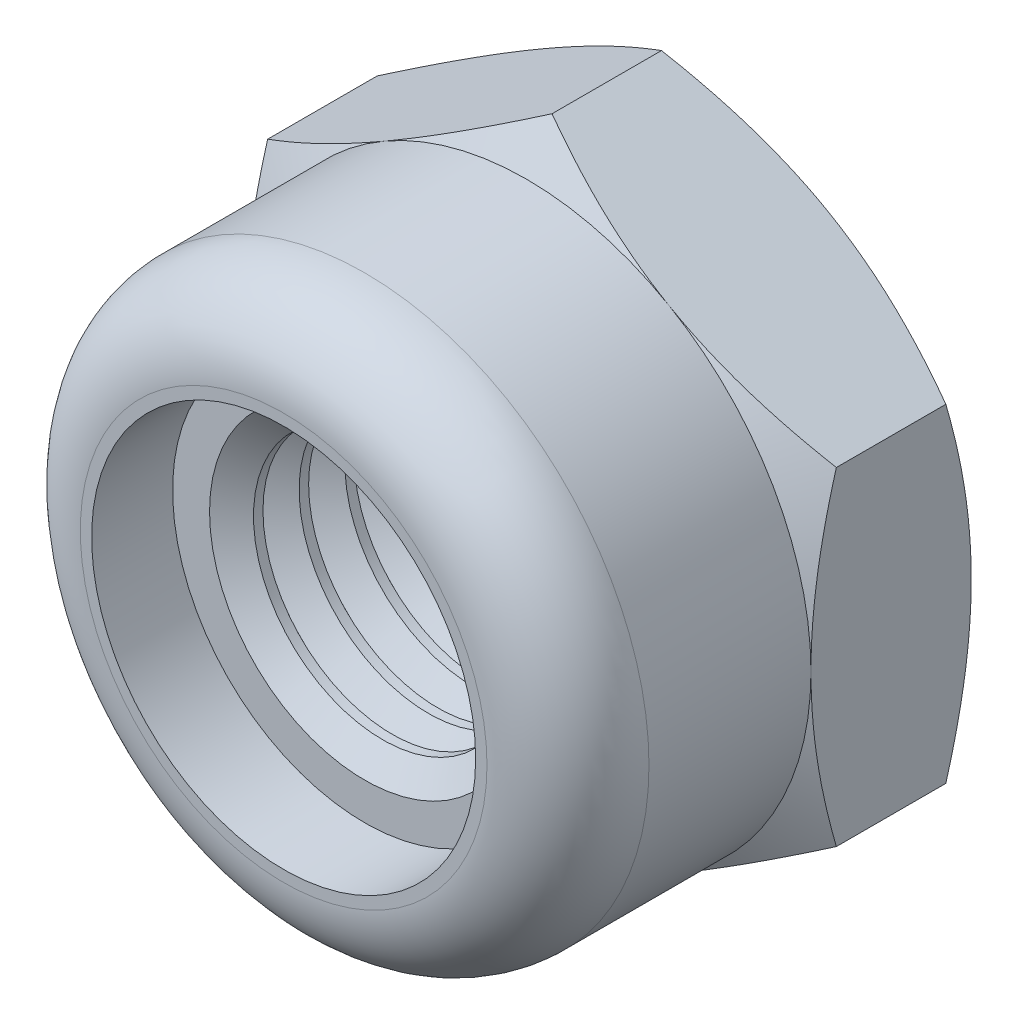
ISO-10303-21;
HEADER;
FILE_DESCRIPTION(('STEP AP214'),'2;1');
FILE_NAME('part.step','',(''),(''),'','','');
FILE_SCHEMA(('AUTOMOTIVE_DESIGN { 1 0 10303 214 1 1 1 1 }'));
ENDSEC;
DATA;
#1=APPLICATION_CONTEXT('core data for automotive mechanical design processes');
#2=APPLICATION_PROTOCOL_DEFINITION('international standard','automotive_design',2000,#1);
#3=PRODUCT_CONTEXT('',#1,'mechanical');
#4=PRODUCT('Part','Part','',(#3));
#5=PRODUCT_RELATED_PRODUCT_CATEGORY('part','',(#4));
#6=PRODUCT_DEFINITION_FORMATION('','',#4);
#7=PRODUCT_DEFINITION_CONTEXT('part definition',#1,'design');
#8=PRODUCT_DEFINITION('design','',#6,#7);
#9=PRODUCT_DEFINITION_SHAPE('','',#8);
#10=(LENGTH_UNIT() NAMED_UNIT(*) SI_UNIT(.MILLI.,.METRE.));
#11=(NAMED_UNIT(*) PLANE_ANGLE_UNIT() SI_UNIT($,.RADIAN.));
#12=(NAMED_UNIT(*) SI_UNIT($,.STERADIAN.) SOLID_ANGLE_UNIT());
#13=UNCERTAINTY_MEASURE_WITH_UNIT(LENGTH_MEASURE(1.E-05),#10,'distance_accuracy_value','');
#14=(GEOMETRIC_REPRESENTATION_CONTEXT(3) GLOBAL_UNCERTAINTY_ASSIGNED_CONTEXT((#13)) GLOBAL_UNIT_ASSIGNED_CONTEXT((#10,
#11,#12)) REPRESENTATION_CONTEXT('',''));
#15=CARTESIAN_POINT('',(0.,0.,0.));
#16=DIRECTION('',(0.,0.,1.));
#17=DIRECTION('',(1.,0.,0.));
#18=AXIS2_PLACEMENT_3D('',#15,#16,#17);
#19=CARTESIAN_POINT('',(0.,0.,-1.55));
#20=DIRECTION('',(0.,0.,1.));
#21=DIRECTION('',(1.,0.,0.));
#22=AXIS2_PLACEMENT_3D('',#19,#20,#21);
#23=CYLINDRICAL_SURFACE('',#22,1.25);
#24=CARTESIAN_POINT('',(0.,0.,-1.25804236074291));
#25=DIRECTION('',(0.,0.,-1.));
#26=DIRECTION('',(-1.,0.,0.));
#27=AXIS2_PLACEMENT_3D('',#24,#25,#26);
#28=CIRCLE('',#27,1.25);
#29=CARTESIAN_POINT('',(1.25,0.,-1.25804236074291));
#30=VERTEX_POINT('',#29);
#31=EDGE_CURVE('E328',#30,#30,#28,.T.);
#32=CARTESIAN_POINT('',(0.,0.,-1.34954811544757));
#33=DIRECTION('',(0.,0.,-1.));
#34=DIRECTION('',(-1.,0.,0.));
#35=AXIS2_PLACEMENT_3D('',#32,#33,#34);
#36=CIRCLE('',#35,1.25);
#37=CARTESIAN_POINT('',(1.25,0.,-1.34954811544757));
#38=VERTEX_POINT('',#37);
#39=EDGE_CURVE('E41',#38,#38,#36,.F.);
#40=CARTESIAN_POINT('',(1.25,0.,-1.25804236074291));
#41=CARTESIAN_POINT('',(1.25,0.,-1.25899554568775));
#42=CARTESIAN_POINT('',(1.25,0.,-1.25994873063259));
#43=CARTESIAN_POINT('',(1.25,0.,-1.26185510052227));
#44=CARTESIAN_POINT('',(1.25,0.,-1.26280828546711));
#45=CARTESIAN_POINT('',(1.25,0.,-1.26471465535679));
#46=CARTESIAN_POINT('',(1.25,0.,-1.26566784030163));
#47=CARTESIAN_POINT('',(1.25,0.,-1.26757421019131));
#48=CARTESIAN_POINT('',(1.25,0.,-1.26852739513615));
#49=CARTESIAN_POINT('',(1.25,0.,-1.27043376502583));
#50=CARTESIAN_POINT('',(1.25,0.,-1.27138694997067));
#51=CARTESIAN_POINT('',(1.25,0.,-1.27329331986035));
#52=CARTESIAN_POINT('',(1.25,0.,-1.27424650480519));
#53=CARTESIAN_POINT('',(1.25,0.,-1.27615287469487));
#54=CARTESIAN_POINT('',(1.25,0.,-1.27710605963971));
#55=CARTESIAN_POINT('',(1.25,0.,-1.27901242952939));
#56=CARTESIAN_POINT('',(1.25,0.,-1.27996561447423));
#57=CARTESIAN_POINT('',(1.25,0.,-1.28187198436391));
#58=CARTESIAN_POINT('',(1.25,0.,-1.28282516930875));
#59=CARTESIAN_POINT('',(1.25,0.,-1.28473153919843));
#60=CARTESIAN_POINT('',(1.25,0.,-1.28568472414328));
#61=CARTESIAN_POINT('',(1.25,0.,-1.28759109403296));
#62=CARTESIAN_POINT('',(1.25,0.,-1.2885442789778));
#63=CARTESIAN_POINT('',(1.25,0.,-1.29045064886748));
#64=CARTESIAN_POINT('',(1.25,0.,-1.29140383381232));
#65=CARTESIAN_POINT('',(1.25,0.,-1.293310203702));
#66=CARTESIAN_POINT('',(1.25,0.,-1.29426338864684));
#67=CARTESIAN_POINT('',(1.25,0.,-1.29616975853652));
#68=CARTESIAN_POINT('',(1.25,0.,-1.29712294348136));
#69=CARTESIAN_POINT('',(1.25,0.,-1.29902931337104));
#70=CARTESIAN_POINT('',(1.25,0.,-1.29998249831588));
#71=CARTESIAN_POINT('',(1.25,0.,-1.30188886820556));
#72=CARTESIAN_POINT('',(1.25,0.,-1.3028420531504));
#73=CARTESIAN_POINT('',(1.25,0.,-1.30474842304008));
#74=CARTESIAN_POINT('',(1.25,0.,-1.30570160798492));
#75=CARTESIAN_POINT('',(1.25,0.,-1.3076079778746));
#76=CARTESIAN_POINT('',(1.25,0.,-1.30856116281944));
#77=CARTESIAN_POINT('',(1.25,0.,-1.31046753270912));
#78=CARTESIAN_POINT('',(1.25,0.,-1.31142071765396));
#79=CARTESIAN_POINT('',(1.25,0.,-1.31332708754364));
#80=CARTESIAN_POINT('',(1.25,0.,-1.31428027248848));
#81=CARTESIAN_POINT('',(1.25,0.,-1.31618664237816));
#82=CARTESIAN_POINT('',(1.25,0.,-1.317139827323));
#83=CARTESIAN_POINT('',(1.25,0.,-1.31904619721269));
#84=CARTESIAN_POINT('',(1.25,0.,-1.31999938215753));
#85=CARTESIAN_POINT('',(1.25,0.,-1.32190575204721));
#86=CARTESIAN_POINT('',(1.25,0.,-1.32285893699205));
#87=CARTESIAN_POINT('',(1.25,0.,-1.32476530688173));
#88=CARTESIAN_POINT('',(1.25,0.,-1.32571849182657));
#89=CARTESIAN_POINT('',(1.25,0.,-1.32762486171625));
#90=CARTESIAN_POINT('',(1.25,0.,-1.32857804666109));
#91=CARTESIAN_POINT('',(1.25,0.,-1.33048441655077));
#92=CARTESIAN_POINT('',(1.25,0.,-1.33143760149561));
#93=CARTESIAN_POINT('',(1.25,0.,-1.33334397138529));
#94=CARTESIAN_POINT('',(1.25,0.,-1.33429715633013));
#95=CARTESIAN_POINT('',(1.25,0.,-1.33620352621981));
#96=CARTESIAN_POINT('',(1.25,0.,-1.33715671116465));
#97=CARTESIAN_POINT('',(1.25,0.,-1.33906308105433));
#98=CARTESIAN_POINT('',(1.25,0.,-1.34001626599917));
#99=CARTESIAN_POINT('',(1.25,0.,-1.34192263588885));
#100=CARTESIAN_POINT('',(1.25,0.,-1.34287582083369));
#101=CARTESIAN_POINT('',(1.25,0.,-1.34478219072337));
#102=CARTESIAN_POINT('',(1.25,0.,-1.34573537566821));
#103=CARTESIAN_POINT('',(1.25,0.,-1.34764174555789));
#104=CARTESIAN_POINT('',(1.25,0.,-1.34859493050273));
#105=CARTESIAN_POINT('',(1.25,0.,-1.34954811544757));
#106=B_SPLINE_CURVE_WITH_KNOTS('',3,(#40,#41,#42,#43,#44,#45,#46,#47,#48,#49,#50,#51,#52,#53,
#54,#55,#56,#57,#58,#59,#60,#61,#62,#63,#64,#65,#66,#67,#68,#69,#70,#71,#72,#73,#74,#75,#76,#77,
#78,#79,#80,#81,#82,#83,#84,#85,#86,#87,#88,#89,#90,#91,#92,#93,#94,#95,#96,#97,#98,#99,#100,
#101,#102,#103,#104,#105),.UNSPECIFIED.,.F.,.F.,(4,2,2,2,2,2,2,2,2,2,2,2,2,2,2,2,2,2,2,2,2,2,2,
2,2,2,2,2,2,2,2,2,4),(0.,0.00285955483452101,0.00571910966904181,0.00857866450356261,
0.0114382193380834,0.0142977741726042,0.017157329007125,0.020016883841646,0.0228764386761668,
0.0257359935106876,0.0285955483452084,0.0314551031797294,0.0343146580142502,0.037174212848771,
0.0400337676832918,0.0428933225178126,0.0457528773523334,0.0486124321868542,0.0514719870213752,
0.054331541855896,0.0571910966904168,0.0600506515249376,0.0629102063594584,0.0657697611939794,
0.0686293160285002,0.071488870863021,0.0743484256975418,0.0772079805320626,0.0800675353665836,
0.0829270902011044,0.0857866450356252,0.088646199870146,0.0915057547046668),.UNSPECIFIED.);
#107=EDGE_CURVE('BSEAM36',#30,#38,#106,.T.);
#108=ORIENTED_EDGE('',*,*,#31,.F.);
#109=ORIENTED_EDGE('',*,*,#39,.F.);
#110=ORIENTED_EDGE('',*,*,#107,.T.);
#111=ORIENTED_EDGE('',*,*,#107,.F.);
#112=EDGE_LOOP('',(#108,#110,#109,#111));
#113=FACE_BOUND('',#112,.T.);
#114=ADVANCED_FACE('F36',(#113),#23,.F.);
#115=CARTESIAN_POINT('',(0.,0.,-0.907938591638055));
#116=DIRECTION('',(0.,0.,-1.));
#117=DIRECTION('',(-1.,0.,0.));
#118=AXIS2_PLACEMENT_3D('',#115,#116,#117);
#119=CIRCLE('',#118,1.25);
#120=CARTESIAN_POINT('',(1.25,0.,-0.907938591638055));
#121=VERTEX_POINT('',#120);
#122=EDGE_CURVE('E331',#121,#121,#119,.T.);
#123=CARTESIAN_POINT('',(0.,0.,-0.816432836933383));
#124=DIRECTION('',(0.,0.,-1.));
#125=DIRECTION('',(-1.,0.,0.));
#126=AXIS2_PLACEMENT_3D('',#123,#124,#125);
#127=CIRCLE('',#126,1.25);
#128=CARTESIAN_POINT('',(1.25,0.,-0.816432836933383));
#129=VERTEX_POINT('',#128);
#130=EDGE_CURVE('E319',#129,#129,#127,.T.);
#131=CARTESIAN_POINT('',(1.25,0.,-0.907938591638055));
#132=CARTESIAN_POINT('',(1.25,0.,-0.906985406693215));
#133=CARTESIAN_POINT('',(1.25,0.,-0.906032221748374));
#134=CARTESIAN_POINT('',(1.25,0.,-0.904125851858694));
#135=CARTESIAN_POINT('',(1.25,0.,-0.903172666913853));
#136=CARTESIAN_POINT('',(1.25,0.,-0.901266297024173));
#137=CARTESIAN_POINT('',(1.25,0.,-0.900313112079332));
#138=CARTESIAN_POINT('',(1.25,0.,-0.898406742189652));
#139=CARTESIAN_POINT('',(1.25,0.,-0.897453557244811));
#140=CARTESIAN_POINT('',(1.25,0.,-0.895547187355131));
#141=CARTESIAN_POINT('',(1.25,0.,-0.89459400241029));
#142=CARTESIAN_POINT('',(1.25,0.,-0.89268763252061));
#143=CARTESIAN_POINT('',(1.25,0.,-0.891734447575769));
#144=CARTESIAN_POINT('',(1.25,0.,-0.889828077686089));
#145=CARTESIAN_POINT('',(1.25,0.,-0.888874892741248));
#146=CARTESIAN_POINT('',(1.25,0.,-0.886968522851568));
#147=CARTESIAN_POINT('',(1.25,0.,-0.886015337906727));
#148=CARTESIAN_POINT('',(1.25,0.,-0.884108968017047));
#149=CARTESIAN_POINT('',(1.25,0.,-0.883155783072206));
#150=CARTESIAN_POINT('',(1.25,0.,-0.881249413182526));
#151=CARTESIAN_POINT('',(1.25,0.,-0.880296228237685));
#152=CARTESIAN_POINT('',(1.25,0.,-0.878389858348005));
#153=CARTESIAN_POINT('',(1.25,0.,-0.877436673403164));
#154=CARTESIAN_POINT('',(1.25,0.,-0.875530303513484));
#155=CARTESIAN_POINT('',(1.25,0.,-0.874577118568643));
#156=CARTESIAN_POINT('',(1.25,0.,-0.872670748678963));
#157=CARTESIAN_POINT('',(1.25,0.,-0.871717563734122));
#158=CARTESIAN_POINT('',(1.25,0.,-0.869811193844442));
#159=CARTESIAN_POINT('',(1.25,0.,-0.868858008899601));
#160=CARTESIAN_POINT('',(1.25,0.,-0.866951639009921));
#161=CARTESIAN_POINT('',(1.25,0.,-0.86599845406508));
#162=CARTESIAN_POINT('',(1.25,0.,-0.8640920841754));
#163=CARTESIAN_POINT('',(1.25,0.,-0.863138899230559));
#164=CARTESIAN_POINT('',(1.25,0.,-0.861232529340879));
#165=CARTESIAN_POINT('',(1.25,0.,-0.860279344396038));
#166=CARTESIAN_POINT('',(1.25,0.,-0.858372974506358));
#167=CARTESIAN_POINT('',(1.25,0.,-0.857419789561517));
#168=CARTESIAN_POINT('',(1.25,0.,-0.855513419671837));
#169=CARTESIAN_POINT('',(1.25,0.,-0.854560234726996));
#170=CARTESIAN_POINT('',(1.25,0.,-0.852653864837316));
#171=CARTESIAN_POINT('',(1.25,0.,-0.851700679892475));
#172=CARTESIAN_POINT('',(1.25,0.,-0.849794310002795));
#173=CARTESIAN_POINT('',(1.25,0.,-0.848841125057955));
#174=CARTESIAN_POINT('',(1.25,0.,-0.846934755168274));
#175=CARTESIAN_POINT('',(1.25,0.,-0.845981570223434));
#176=CARTESIAN_POINT('',(1.25,0.,-0.844075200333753));
#177=CARTESIAN_POINT('',(1.25,0.,-0.843122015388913));
#178=CARTESIAN_POINT('',(1.25,0.,-0.841215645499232));
#179=CARTESIAN_POINT('',(1.25,0.,-0.840262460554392));
#180=CARTESIAN_POINT('',(1.25,0.,-0.838356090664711));
#181=CARTESIAN_POINT('',(1.25,0.,-0.837402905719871));
#182=CARTESIAN_POINT('',(1.25,0.,-0.83549653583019));
#183=CARTESIAN_POINT('',(1.25,0.,-0.834543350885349));
#184=CARTESIAN_POINT('',(1.25,0.,-0.832636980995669));
#185=CARTESIAN_POINT('',(1.25,0.,-0.831683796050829));
#186=CARTESIAN_POINT('',(1.25,0.,-0.829777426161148));
#187=CARTESIAN_POINT('',(1.25,0.,-0.828824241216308));
#188=CARTESIAN_POINT('',(1.25,0.,-0.826917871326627));
#189=CARTESIAN_POINT('',(1.25,0.,-0.825964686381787));
#190=CARTESIAN_POINT('',(1.25,0.,-0.824058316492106));
#191=CARTESIAN_POINT('',(1.25,0.,-0.823105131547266));
#192=CARTESIAN_POINT('',(1.25,0.,-0.821198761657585));
#193=CARTESIAN_POINT('',(1.25,0.,-0.820245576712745));
#194=CARTESIAN_POINT('',(1.25,0.,-0.818339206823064));
#195=CARTESIAN_POINT('',(1.25,0.,-0.817386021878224));
#196=CARTESIAN_POINT('',(1.25,0.,-0.816432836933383));
#197=B_SPLINE_CURVE_WITH_KNOTS('',3,(#131,#132,#133,#134,#135,#136,#137,#138,#139,#140,#141,
#142,#143,#144,#145,#146,#147,#148,#149,#150,#151,#152,#153,#154,#155,#156,#157,#158,#159,#160,
#161,#162,#163,#164,#165,#166,#167,#168,#169,#170,#171,#172,#173,#174,#175,#176,#177,#178,#179,
#180,#181,#182,#183,#184,#185,#186,#187,#188,#189,#190,#191,#192,#193,#194,#195,#196),
.UNSPECIFIED.,.F.,.F.,(4,2,2,2,2,2,2,2,2,2,2,2,2,2,2,2,2,2,2,2,2,2,2,2,2,2,2,2,2,2,2,2,4),(0.,
0.00285955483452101,0.00571910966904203,0.00857866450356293,0.0114382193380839,
0.014297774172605,0.0171573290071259,0.0200168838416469,0.0228764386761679,0.0257359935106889,
0.0285955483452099,0.0314551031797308,0.0343146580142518,0.0371742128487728,0.0400337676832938,
0.0428933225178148,0.0457528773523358,0.0486124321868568,0.0514719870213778,0.0543315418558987,
0.0571910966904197,0.0600506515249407,0.0629102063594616,0.0657697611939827,0.0686293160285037,
0.0714888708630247,0.0743484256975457,0.0772079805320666,0.0800675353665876,0.0829270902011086,
0.0857866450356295,0.0886461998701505,0.0915057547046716),.UNSPECIFIED.);
#198=EDGE_CURVE('BSEAM335',#121,#129,#197,.T.);
#199=ORIENTED_EDGE('',*,*,#122,.T.);
#200=ORIENTED_EDGE('',*,*,#130,.F.);
#201=ORIENTED_EDGE('',*,*,#198,.T.);
#202=ORIENTED_EDGE('',*,*,#198,.F.);
#203=EDGE_LOOP('',(#199,#201,#200,#202));
#204=FACE_BOUND('',#203,.T.);
#205=ADVANCED_FACE('F335',(#204),#23,.F.);
#206=CARTESIAN_POINT('',(0.,0.,-0.466329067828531));
#207=DIRECTION('',(0.,0.,-1.));
#208=DIRECTION('',(-1.,0.,0.));
#209=AXIS2_PLACEMENT_3D('',#206,#207,#208);
#210=CIRCLE('',#209,1.25);
#211=CARTESIAN_POINT('',(1.25,0.,-0.466329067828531));
#212=VERTEX_POINT('',#211);
#213=EDGE_CURVE('E322',#212,#212,#210,.T.);
#214=CARTESIAN_POINT('',(0.,0.,-0.37482331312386));
#215=DIRECTION('',(0.,0.,-1.));
#216=DIRECTION('',(-1.,0.,0.));
#217=AXIS2_PLACEMENT_3D('',#214,#215,#216);
#218=CIRCLE('',#217,1.25);
#219=CARTESIAN_POINT('',(1.25,0.,-0.37482331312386));
#220=VERTEX_POINT('',#219);
#221=EDGE_CURVE('E310',#220,#220,#218,.T.);
#222=CARTESIAN_POINT('',(1.25,0.,-0.466329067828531));
#223=CARTESIAN_POINT('',(1.25,0.,-0.465375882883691));
#224=CARTESIAN_POINT('',(1.25,0.,-0.46442269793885));
#225=CARTESIAN_POINT('',(1.25,0.,-0.46251632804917));
#226=CARTESIAN_POINT('',(1.25,0.,-0.461563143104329));
#227=CARTESIAN_POINT('',(1.25,0.,-0.459656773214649));
#228=CARTESIAN_POINT('',(1.25,0.,-0.458703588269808));
#229=CARTESIAN_POINT('',(1.25,0.,-0.456797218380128));
#230=CARTESIAN_POINT('',(1.25,0.,-0.455844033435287));
#231=CARTESIAN_POINT('',(1.25,0.,-0.453937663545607));
#232=CARTESIAN_POINT('',(1.25,0.,-0.452984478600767));
#233=CARTESIAN_POINT('',(1.25,0.,-0.451078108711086));
#234=CARTESIAN_POINT('',(1.25,0.,-0.450124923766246));
#235=CARTESIAN_POINT('',(1.25,0.,-0.448218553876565));
#236=CARTESIAN_POINT('',(1.25,0.,-0.447265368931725));
#237=CARTESIAN_POINT('',(1.25,0.,-0.445358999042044));
#238=CARTESIAN_POINT('',(1.25,0.,-0.444405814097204));
#239=CARTESIAN_POINT('',(1.25,0.,-0.442499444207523));
#240=CARTESIAN_POINT('',(1.25,0.,-0.441546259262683));
#241=CARTESIAN_POINT('',(1.25,0.,-0.439639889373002));
#242=CARTESIAN_POINT('',(1.25,0.,-0.438686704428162));
#243=CARTESIAN_POINT('',(1.25,0.,-0.436780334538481));
#244=CARTESIAN_POINT('',(1.25,0.,-0.435827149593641));
#245=CARTESIAN_POINT('',(1.25,0.,-0.43392077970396));
#246=CARTESIAN_POINT('',(1.25,0.,-0.43296759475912));
#247=CARTESIAN_POINT('',(1.25,0.,-0.431061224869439));
#248=CARTESIAN_POINT('',(1.25,0.,-0.430108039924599));
#249=CARTESIAN_POINT('',(1.25,0.,-0.428201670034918));
#250=CARTESIAN_POINT('',(1.25,0.,-0.427248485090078));
#251=CARTESIAN_POINT('',(1.25,0.,-0.425342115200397));
#252=CARTESIAN_POINT('',(1.25,0.,-0.424388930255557));
#253=CARTESIAN_POINT('',(1.25,0.,-0.422482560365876));
#254=CARTESIAN_POINT('',(1.25,0.,-0.421529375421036));
#255=CARTESIAN_POINT('',(1.25,0.,-0.419623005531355));
#256=CARTESIAN_POINT('',(1.25,0.,-0.418669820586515));
#257=CARTESIAN_POINT('',(1.25,0.,-0.416763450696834));
#258=CARTESIAN_POINT('',(1.25,0.,-0.415810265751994));
#259=CARTESIAN_POINT('',(1.25,0.,-0.413903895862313));
#260=CARTESIAN_POINT('',(1.25,0.,-0.412950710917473));
#261=CARTESIAN_POINT('',(1.25,0.,-0.411044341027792));
#262=CARTESIAN_POINT('',(1.25,0.,-0.410091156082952));
#263=CARTESIAN_POINT('',(1.25,0.,-0.408184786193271));
#264=CARTESIAN_POINT('',(1.25,0.,-0.407231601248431));
#265=CARTESIAN_POINT('',(1.25,0.,-0.40532523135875));
#266=CARTESIAN_POINT('',(1.25,0.,-0.40437204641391));
#267=CARTESIAN_POINT('',(1.25,0.,-0.402465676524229));
#268=CARTESIAN_POINT('',(1.25,0.,-0.401512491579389));
#269=CARTESIAN_POINT('',(1.25,0.,-0.399606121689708));
#270=CARTESIAN_POINT('',(1.25,0.,-0.398652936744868));
#271=CARTESIAN_POINT('',(1.25,0.,-0.396746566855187));
#272=CARTESIAN_POINT('',(1.25,0.,-0.395793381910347));
#273=CARTESIAN_POINT('',(1.25,0.,-0.393887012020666));
#274=CARTESIAN_POINT('',(1.25,0.,-0.392933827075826));
#275=CARTESIAN_POINT('',(1.25,0.,-0.391027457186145));
#276=CARTESIAN_POINT('',(1.25,0.,-0.390074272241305));
#277=CARTESIAN_POINT('',(1.25,0.,-0.388167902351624));
#278=CARTESIAN_POINT('',(1.25,0.,-0.387214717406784));
#279=CARTESIAN_POINT('',(1.25,0.,-0.385308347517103));
#280=CARTESIAN_POINT('',(1.25,0.,-0.384355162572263));
#281=CARTESIAN_POINT('',(1.25,0.,-0.382448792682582));
#282=CARTESIAN_POINT('',(1.25,0.,-0.381495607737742));
#283=CARTESIAN_POINT('',(1.25,0.,-0.379589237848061));
#284=CARTESIAN_POINT('',(1.25,0.,-0.378636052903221));
#285=CARTESIAN_POINT('',(1.25,0.,-0.37672968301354));
#286=CARTESIAN_POINT('',(1.25,0.,-0.3757764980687));
#287=CARTESIAN_POINT('',(1.25,0.,-0.37482331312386));
#288=B_SPLINE_CURVE_WITH_KNOTS('',3,(#222,#223,#224,#225,#226,#227,#228,#229,#230,#231,#232,
#233,#234,#235,#236,#237,#238,#239,#240,#241,#242,#243,#244,#245,#246,#247,#248,#249,#250,#251,
#252,#253,#254,#255,#256,#257,#258,#259,#260,#261,#262,#263,#264,#265,#266,#267,#268,#269,#270,
#271,#272,#273,#274,#275,#276,#277,#278,#279,#280,#281,#282,#283,#284,#285,#286,#287),
.UNSPECIFIED.,.F.,.F.,(4,2,2,2,2,2,2,2,2,2,2,2,2,2,2,2,2,2,2,2,2,2,2,2,2,2,2,2,2,2,2,2,4),(0.,
0.00285955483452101,0.00571910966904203,0.00857866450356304,0.0114382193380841,
0.0142977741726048,0.0171573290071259,0.0200168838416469,0.0228764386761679,0.0257359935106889,
0.0285955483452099,0.0314551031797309,0.0343146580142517,0.0371742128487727,0.0400337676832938,
0.0428933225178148,0.0457528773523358,0.0486124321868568,0.0514719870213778,0.0543315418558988,
0.0571910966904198,0.0600506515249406,0.0629102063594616,0.0657697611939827,0.0686293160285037,
0.0714888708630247,0.0743484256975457,0.0772079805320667,0.0800675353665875,0.0829270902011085,
0.0857866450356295,0.0886461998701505,0.0915057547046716),.UNSPECIFIED.);
#289=EDGE_CURVE('BSEAM432',#212,#220,#288,.T.);
#290=ORIENTED_EDGE('',*,*,#213,.T.);
#291=ORIENTED_EDGE('',*,*,#221,.F.);
#292=ORIENTED_EDGE('',*,*,#289,.T.);
#293=ORIENTED_EDGE('',*,*,#289,.F.);
#294=EDGE_LOOP('',(#290,#292,#291,#293));
#295=FACE_BOUND('',#294,.T.);
#296=ADVANCED_FACE('F432',(#295),#23,.F.);
#297=CARTESIAN_POINT('',(0.,0.,-0.0247195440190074));
#298=DIRECTION('',(0.,0.,-1.));
#299=DIRECTION('',(-1.,0.,0.));
#300=AXIS2_PLACEMENT_3D('',#297,#298,#299);
#301=CIRCLE('',#300,1.25);
#302=CARTESIAN_POINT('',(1.25,0.,-0.0247195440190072));
#303=VERTEX_POINT('',#302);
#304=EDGE_CURVE('E313',#303,#303,#301,.T.);
#305=CARTESIAN_POINT('',(0.,0.,0.0667862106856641));
#306=DIRECTION('',(0.,0.,-1.));
#307=DIRECTION('',(-1.,0.,0.));
#308=AXIS2_PLACEMENT_3D('',#305,#306,#307);
#309=CIRCLE('',#308,1.25);
#310=CARTESIAN_POINT('',(1.25,0.,0.0667862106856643));
#311=VERTEX_POINT('',#310);
#312=EDGE_CURVE('E301',#311,#311,#309,.T.);
#313=CARTESIAN_POINT('',(1.25,0.,-0.0247195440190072));
#314=CARTESIAN_POINT('',(1.25,0.,-0.0237663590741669));
#315=CARTESIAN_POINT('',(1.25,0.,-0.0228131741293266));
#316=CARTESIAN_POINT('',(1.25,0.,-0.0209068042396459));
#317=CARTESIAN_POINT('',(1.25,0.,-0.0199536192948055));
#318=CARTESIAN_POINT('',(1.25,0.,-0.0180472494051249));
#319=CARTESIAN_POINT('',(1.25,0.,-0.0170940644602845));
#320=CARTESIAN_POINT('',(1.25,0.,-0.0151876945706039));
#321=CARTESIAN_POINT('',(1.25,0.,-0.0142345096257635));
#322=CARTESIAN_POINT('',(1.25,0.,-0.0123281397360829));
#323=CARTESIAN_POINT('',(1.25,0.,-0.0113749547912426));
#324=CARTESIAN_POINT('',(1.25,0.,-0.00946858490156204));
#325=CARTESIAN_POINT('',(1.25,0.,-0.0085153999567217));
#326=CARTESIAN_POINT('',(1.25,0.,-0.00660903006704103));
#327=CARTESIAN_POINT('',(1.25,0.,-0.00565584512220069));
#328=CARTESIAN_POINT('',(1.25,0.,-0.00374947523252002));
#329=CARTESIAN_POINT('',(1.25,0.,-0.00279629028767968));
#330=CARTESIAN_POINT('',(1.25,0.,-0.000889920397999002));
#331=CARTESIAN_POINT('',(1.25,0.,6.32645468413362E-05));
#332=CARTESIAN_POINT('',(1.25,0.,0.00196963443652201));
#333=CARTESIAN_POINT('',(1.25,0.,0.00292281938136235));
#334=CARTESIAN_POINT('',(1.25,0.,0.00482918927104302));
#335=CARTESIAN_POINT('',(1.25,0.,0.00578237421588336));
#336=CARTESIAN_POINT('',(1.25,0.,0.00768874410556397));
#337=CARTESIAN_POINT('',(1.25,0.,0.00864192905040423));
#338=CARTESIAN_POINT('',(1.25,0.,0.0105482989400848));
#339=CARTESIAN_POINT('',(1.25,0.,0.0115014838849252));
#340=CARTESIAN_POINT('',(1.25,0.,0.0134078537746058));
#341=CARTESIAN_POINT('',(1.25,0.,0.0143610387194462));
#342=CARTESIAN_POINT('',(1.25,0.,0.0162674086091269));
#343=CARTESIAN_POINT('',(1.25,0.,0.0172205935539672));
#344=CARTESIAN_POINT('',(1.25,0.,0.0191269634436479));
#345=CARTESIAN_POINT('',(1.25,0.,0.0200801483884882));
#346=CARTESIAN_POINT('',(1.25,0.,0.0219865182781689));
#347=CARTESIAN_POINT('',(1.25,0.,0.0229397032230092));
#348=CARTESIAN_POINT('',(1.25,0.,0.0248460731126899));
#349=CARTESIAN_POINT('',(1.25,0.,0.0257992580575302));
#350=CARTESIAN_POINT('',(1.25,0.,0.0277056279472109));
#351=CARTESIAN_POINT('',(1.25,0.,0.0286588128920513));
#352=CARTESIAN_POINT('',(1.25,0.,0.0305651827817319));
#353=CARTESIAN_POINT('',(1.25,0.,0.0315183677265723));
#354=CARTESIAN_POINT('',(1.25,0.,0.0334247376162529));
#355=CARTESIAN_POINT('',(1.25,0.,0.0343779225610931));
#356=CARTESIAN_POINT('',(1.25,0.,0.0362842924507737));
#357=CARTESIAN_POINT('',(1.25,0.,0.0372374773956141));
#358=CARTESIAN_POINT('',(1.25,0.,0.0391438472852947));
#359=CARTESIAN_POINT('',(1.25,0.,0.0400970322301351));
#360=CARTESIAN_POINT('',(1.25,0.,0.0420034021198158));
#361=CARTESIAN_POINT('',(1.25,0.,0.0429565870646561));
#362=CARTESIAN_POINT('',(1.25,0.,0.0448629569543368));
#363=CARTESIAN_POINT('',(1.25,0.,0.0458161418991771));
#364=CARTESIAN_POINT('',(1.25,0.,0.0477225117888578));
#365=CARTESIAN_POINT('',(1.25,0.,0.0486756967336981));
#366=CARTESIAN_POINT('',(1.25,0.,0.0505820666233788));
#367=CARTESIAN_POINT('',(1.25,0.,0.0515352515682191));
#368=CARTESIAN_POINT('',(1.25,0.,0.0534416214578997));
#369=CARTESIAN_POINT('',(1.25,0.,0.05439480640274));
#370=CARTESIAN_POINT('',(1.25,0.,0.0563011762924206));
#371=CARTESIAN_POINT('',(1.25,0.,0.057254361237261));
#372=CARTESIAN_POINT('',(1.25,0.,0.0591607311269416));
#373=CARTESIAN_POINT('',(1.25,0.,0.060113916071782));
#374=CARTESIAN_POINT('',(1.25,0.,0.0620202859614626));
#375=CARTESIAN_POINT('',(1.25,0.,0.062973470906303));
#376=CARTESIAN_POINT('',(1.25,0.,0.0648798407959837));
#377=CARTESIAN_POINT('',(1.25,0.,0.065833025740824));
#378=CARTESIAN_POINT('',(1.25,0.,0.0667862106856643));
#379=B_SPLINE_CURVE_WITH_KNOTS('',3,(#313,#314,#315,#316,#317,#318,#319,#320,#321,#322,#323,
#324,#325,#326,#327,#328,#329,#330,#331,#332,#333,#334,#335,#336,#337,#338,#339,#340,#341,#342,
#343,#344,#345,#346,#347,#348,#349,#350,#351,#352,#353,#354,#355,#356,#357,#358,#359,#360,#361,
#362,#363,#364,#365,#366,#367,#368,#369,#370,#371,#372,#373,#374,#375,#376,#377,#378),
.UNSPECIFIED.,.F.,.F.,(4,2,2,2,2,2,2,2,2,2,2,2,2,2,2,2,2,2,2,2,2,2,2,2,2,2,2,2,2,2,2,2,4),(0.,
0.00285955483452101,0.00571910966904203,0.00857866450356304,0.0114382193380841,
0.0142977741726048,0.0171573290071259,0.0200168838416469,0.0228764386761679,0.0257359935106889,
0.0285955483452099,0.0314551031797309,0.0343146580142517,0.0371742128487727,0.0400337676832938,
0.0428933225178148,0.0457528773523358,0.0486124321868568,0.0514719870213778,0.0543315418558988,
0.0571910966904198,0.0600506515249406,0.0629102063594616,0.0657697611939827,0.0686293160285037,
0.0714888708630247,0.0743484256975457,0.0772079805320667,0.0800675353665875,0.0829270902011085,
0.0857866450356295,0.0886461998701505,0.0915057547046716),.UNSPECIFIED.);
#380=EDGE_CURVE('BSEAM436',#303,#311,#379,.T.);
#381=ORIENTED_EDGE('',*,*,#304,.T.);
#382=ORIENTED_EDGE('',*,*,#312,.F.);
#383=ORIENTED_EDGE('',*,*,#380,.T.);
#384=ORIENTED_EDGE('',*,*,#380,.F.);
#385=EDGE_LOOP('',(#381,#383,#382,#384));
#386=FACE_BOUND('',#385,.T.);
#387=ADVANCED_FACE('F436',(#386),#23,.F.);
#388=CARTESIAN_POINT('',(0.,0.,0.416889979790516));
#389=DIRECTION('',(0.,0.,-1.));
#390=DIRECTION('',(-1.,0.,0.));
#391=AXIS2_PLACEMENT_3D('',#388,#389,#390);
#392=CIRCLE('',#391,1.25);
#393=CARTESIAN_POINT('',(1.25,0.,0.416889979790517));
#394=VERTEX_POINT('',#393);
#395=EDGE_CURVE('E304',#394,#394,#392,.T.);
#396=CARTESIAN_POINT('',(0.,0.,0.508395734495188));
#397=DIRECTION('',(0.,0.,-1.));
#398=DIRECTION('',(-1.,0.,0.));
#399=AXIS2_PLACEMENT_3D('',#396,#397,#398);
#400=CIRCLE('',#399,1.25);
#401=CARTESIAN_POINT('',(1.25,0.,0.508395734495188));
#402=VERTEX_POINT('',#401);
#403=EDGE_CURVE('E292',#402,#402,#400,.T.);
#404=CARTESIAN_POINT('',(1.25,0.,0.416889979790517));
#405=CARTESIAN_POINT('',(1.25,0.,0.417843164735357));
#406=CARTESIAN_POINT('',(1.25,0.,0.418796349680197));
#407=CARTESIAN_POINT('',(1.25,0.,0.420702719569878));
#408=CARTESIAN_POINT('',(1.25,0.,0.421655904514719));
#409=CARTESIAN_POINT('',(1.25,0.,0.423562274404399));
#410=CARTESIAN_POINT('',(1.25,0.,0.424515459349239));
#411=CARTESIAN_POINT('',(1.25,0.,0.42642182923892));
#412=CARTESIAN_POINT('',(1.25,0.,0.427375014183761));
#413=CARTESIAN_POINT('',(1.25,0.,0.429281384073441));
#414=CARTESIAN_POINT('',(1.25,0.,0.430234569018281));
#415=CARTESIAN_POINT('',(1.25,0.,0.432140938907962));
#416=CARTESIAN_POINT('',(1.25,0.,0.433094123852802));
#417=CARTESIAN_POINT('',(1.25,0.,0.435000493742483));
#418=CARTESIAN_POINT('',(1.25,0.,0.435953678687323));
#419=CARTESIAN_POINT('',(1.25,0.,0.437860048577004));
#420=CARTESIAN_POINT('',(1.25,0.,0.438813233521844));
#421=CARTESIAN_POINT('',(1.25,0.,0.440719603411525));
#422=CARTESIAN_POINT('',(1.25,0.,0.441672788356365));
#423=CARTESIAN_POINT('',(1.25,0.,0.443579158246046));
#424=CARTESIAN_POINT('',(1.25,0.,0.444532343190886));
#425=CARTESIAN_POINT('',(1.25,0.,0.446438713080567));
#426=CARTESIAN_POINT('',(1.25,0.,0.447391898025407));
#427=CARTESIAN_POINT('',(1.25,0.,0.449298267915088));
#428=CARTESIAN_POINT('',(1.25,0.,0.450251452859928));
#429=CARTESIAN_POINT('',(1.25,0.,0.452157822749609));
#430=CARTESIAN_POINT('',(1.25,0.,0.453111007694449));
#431=CARTESIAN_POINT('',(1.25,0.,0.45501737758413));
#432=CARTESIAN_POINT('',(1.25,0.,0.45597056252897));
#433=CARTESIAN_POINT('',(1.25,0.,0.457876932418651));
#434=CARTESIAN_POINT('',(1.25,0.,0.458830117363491));
#435=CARTESIAN_POINT('',(1.25,0.,0.460736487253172));
#436=CARTESIAN_POINT('',(1.25,0.,0.461689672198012));
#437=CARTESIAN_POINT('',(1.25,0.,0.463596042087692));
#438=CARTESIAN_POINT('',(1.25,0.,0.464549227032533));
#439=CARTESIAN_POINT('',(1.25,0.,0.466455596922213));
#440=CARTESIAN_POINT('',(1.25,0.,0.467408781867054));
#441=CARTESIAN_POINT('',(1.25,0.,0.469315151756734));
#442=CARTESIAN_POINT('',(1.25,0.,0.470268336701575));
#443=CARTESIAN_POINT('',(1.25,0.,0.472174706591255));
#444=CARTESIAN_POINT('',(1.25,0.,0.473127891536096));
#445=CARTESIAN_POINT('',(1.25,0.,0.475034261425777));
#446=CARTESIAN_POINT('',(1.25,0.,0.475987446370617));
#447=CARTESIAN_POINT('',(1.25,0.,0.477893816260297));
#448=CARTESIAN_POINT('',(1.25,0.,0.478847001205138));
#449=CARTESIAN_POINT('',(1.25,0.,0.480753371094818));
#450=CARTESIAN_POINT('',(1.25,0.,0.481706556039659));
#451=CARTESIAN_POINT('',(1.25,0.,0.483612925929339));
#452=CARTESIAN_POINT('',(1.25,0.,0.48456611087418));
#453=CARTESIAN_POINT('',(1.25,0.,0.48647248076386));
#454=CARTESIAN_POINT('',(1.25,0.,0.4874256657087));
#455=CARTESIAN_POINT('',(1.25,0.,0.489332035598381));
#456=CARTESIAN_POINT('',(1.25,0.,0.490285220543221));
#457=CARTESIAN_POINT('',(1.25,0.,0.492191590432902));
#458=CARTESIAN_POINT('',(1.25,0.,0.493144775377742));
#459=CARTESIAN_POINT('',(1.25,0.,0.495051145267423));
#460=CARTESIAN_POINT('',(1.25,0.,0.496004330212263));
#461=CARTESIAN_POINT('',(1.25,0.,0.497910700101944));
#462=CARTESIAN_POINT('',(1.25,0.,0.498863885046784));
#463=CARTESIAN_POINT('',(1.25,0.,0.500770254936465));
#464=CARTESIAN_POINT('',(1.25,0.,0.501723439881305));
#465=CARTESIAN_POINT('',(1.25,0.,0.503629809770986));
#466=CARTESIAN_POINT('',(1.25,0.,0.504582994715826));
#467=CARTESIAN_POINT('',(1.25,0.,0.506489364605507));
#468=CARTESIAN_POINT('',(1.25,0.,0.507442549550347));
#469=CARTESIAN_POINT('',(1.25,0.,0.508395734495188));
#470=B_SPLINE_CURVE_WITH_KNOTS('',3,(#404,#405,#406,#407,#408,#409,#410,#411,#412,#413,#414,
#415,#416,#417,#418,#419,#420,#421,#422,#423,#424,#425,#426,#427,#428,#429,#430,#431,#432,#433,
#434,#435,#436,#437,#438,#439,#440,#441,#442,#443,#444,#445,#446,#447,#448,#449,#450,#451,#452,
#453,#454,#455,#456,#457,#458,#459,#460,#461,#462,#463,#464,#465,#466,#467,#468,#469),
.UNSPECIFIED.,.F.,.F.,(4,2,2,2,2,2,2,2,2,2,2,2,2,2,2,2,2,2,2,2,2,2,2,2,2,2,2,2,2,2,2,2,4),(0.,
0.0028595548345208,0.00571910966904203,0.00857866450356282,0.0114382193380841,
0.0142977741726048,0.0171573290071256,0.0200168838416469,0.0228764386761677,0.0257359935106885,
0.0285955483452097,0.0314551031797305,0.0343146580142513,0.0371742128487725,0.0400337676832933,
0.0428933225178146,0.0457528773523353,0.0486124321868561,0.0514719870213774,0.0543315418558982,
0.0571910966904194,0.0600506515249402,0.062910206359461,0.0657697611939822,0.068629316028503,
0.0714888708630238,0.074348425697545,0.0772079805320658,0.0800675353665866,0.0829270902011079,
0.0857866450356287,0.0886461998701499,0.0915057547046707),.UNSPECIFIED.);
#471=EDGE_CURVE('BSEAM446',#394,#402,#470,.T.);
#472=ORIENTED_EDGE('',*,*,#395,.T.);
#473=ORIENTED_EDGE('',*,*,#403,.F.);
#474=ORIENTED_EDGE('',*,*,#471,.T.);
#475=ORIENTED_EDGE('',*,*,#471,.F.);
#476=EDGE_LOOP('',(#472,#474,#473,#475));
#477=FACE_BOUND('',#476,.T.);
#478=ADVANCED_FACE('F446',(#477),#23,.F.);
#479=CARTESIAN_POINT('',(0.,0.,0.85849950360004));
#480=DIRECTION('',(0.,0.,-1.));
#481=DIRECTION('',(-1.,0.,0.));
#482=AXIS2_PLACEMENT_3D('',#479,#480,#481);
#483=CIRCLE('',#482,1.25);
#484=CARTESIAN_POINT('',(1.25,0.,0.85849950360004));
#485=VERTEX_POINT('',#484);
#486=EDGE_CURVE('E295',#485,#485,#483,.T.);
#487=CARTESIAN_POINT('',(0.,0.,0.950005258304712));
#488=DIRECTION('',(0.,0.,-1.));
#489=DIRECTION('',(-1.,0.,0.));
#490=AXIS2_PLACEMENT_3D('',#487,#488,#489);
#491=CIRCLE('',#490,1.25);
#492=CARTESIAN_POINT('',(1.25,0.,0.950005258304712));
#493=VERTEX_POINT('',#492);
#494=EDGE_CURVE('E283',#493,#493,#491,.T.);
#495=CARTESIAN_POINT('',(1.25,0.,0.85849950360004));
#496=CARTESIAN_POINT('',(1.25,0.,0.859452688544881));
#497=CARTESIAN_POINT('',(1.25,0.,0.860405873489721));
#498=CARTESIAN_POINT('',(1.25,0.,0.862312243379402));
#499=CARTESIAN_POINT('',(1.25,0.,0.863265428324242));
#500=CARTESIAN_POINT('',(1.25,0.,0.865171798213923));
#501=CARTESIAN_POINT('',(1.25,0.,0.866124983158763));
#502=CARTESIAN_POINT('',(1.25,0.,0.868031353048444));
#503=CARTESIAN_POINT('',(1.25,0.,0.868984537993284));
#504=CARTESIAN_POINT('',(1.25,0.,0.870890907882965));
#505=CARTESIAN_POINT('',(1.25,0.,0.871844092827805));
#506=CARTESIAN_POINT('',(1.25,0.,0.873750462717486));
#507=CARTESIAN_POINT('',(1.25,0.,0.874703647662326));
#508=CARTESIAN_POINT('',(1.25,0.,0.876610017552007));
#509=CARTESIAN_POINT('',(1.25,0.,0.877563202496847));
#510=CARTESIAN_POINT('',(1.25,0.,0.879469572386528));
#511=CARTESIAN_POINT('',(1.25,0.,0.880422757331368));
#512=CARTESIAN_POINT('',(1.25,0.,0.882329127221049));
#513=CARTESIAN_POINT('',(1.25,0.,0.883282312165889));
#514=CARTESIAN_POINT('',(1.25,0.,0.88518868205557));
#515=CARTESIAN_POINT('',(1.25,0.,0.88614186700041));
#516=CARTESIAN_POINT('',(1.25,0.,0.88804823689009));
#517=CARTESIAN_POINT('',(1.25,0.,0.889001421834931));
#518=CARTESIAN_POINT('',(1.25,0.,0.890907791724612));
#519=CARTESIAN_POINT('',(1.25,0.,0.891860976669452));
#520=CARTESIAN_POINT('',(1.25,0.,0.893767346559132));
#521=CARTESIAN_POINT('',(1.25,0.,0.894720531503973));
#522=CARTESIAN_POINT('',(1.25,0.,0.896626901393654));
#523=CARTESIAN_POINT('',(1.25,0.,0.897580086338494));
#524=CARTESIAN_POINT('',(1.25,0.,0.899486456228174));
#525=CARTESIAN_POINT('',(1.25,0.,0.900439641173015));
#526=CARTESIAN_POINT('',(1.25,0.,0.902346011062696));
#527=CARTESIAN_POINT('',(1.25,0.,0.903299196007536));
#528=CARTESIAN_POINT('',(1.25,0.,0.905205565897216));
#529=CARTESIAN_POINT('',(1.25,0.,0.906158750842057));
#530=CARTESIAN_POINT('',(1.25,0.,0.908065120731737));
#531=CARTESIAN_POINT('',(1.25,0.,0.909018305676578));
#532=CARTESIAN_POINT('',(1.25,0.,0.910924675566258));
#533=CARTESIAN_POINT('',(1.25,0.,0.911877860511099));
#534=CARTESIAN_POINT('',(1.25,0.,0.913784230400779));
#535=CARTESIAN_POINT('',(1.25,0.,0.91473741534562));
#536=CARTESIAN_POINT('',(1.25,0.,0.9166437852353));
#537=CARTESIAN_POINT('',(1.25,0.,0.917596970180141));
#538=CARTESIAN_POINT('',(1.25,0.,0.919503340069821));
#539=CARTESIAN_POINT('',(1.25,0.,0.920456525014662));
#540=CARTESIAN_POINT('',(1.25,0.,0.922362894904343));
#541=CARTESIAN_POINT('',(1.25,0.,0.923316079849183));
#542=CARTESIAN_POINT('',(1.25,0.,0.925222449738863));
#543=CARTESIAN_POINT('',(1.25,0.,0.926175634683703));
#544=CARTESIAN_POINT('',(1.25,0.,0.928082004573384));
#545=CARTESIAN_POINT('',(1.25,0.,0.929035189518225));
#546=CARTESIAN_POINT('',(1.25,0.,0.930941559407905));
#547=CARTESIAN_POINT('',(1.25,0.,0.931894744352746));
#548=CARTESIAN_POINT('',(1.25,0.,0.933801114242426));
#549=CARTESIAN_POINT('',(1.25,0.,0.934754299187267));
#550=CARTESIAN_POINT('',(1.25,0.,0.936660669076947));
#551=CARTESIAN_POINT('',(1.25,0.,0.937613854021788));
#552=CARTESIAN_POINT('',(1.25,0.,0.939520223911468));
#553=CARTESIAN_POINT('',(1.25,0.,0.940473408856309));
#554=CARTESIAN_POINT('',(1.25,0.,0.942379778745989));
#555=CARTESIAN_POINT('',(1.25,0.,0.94333296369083));
#556=CARTESIAN_POINT('',(1.25,0.,0.94523933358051));
#557=CARTESIAN_POINT('',(1.25,0.,0.946192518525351));
#558=CARTESIAN_POINT('',(1.25,0.,0.948098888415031));
#559=CARTESIAN_POINT('',(1.25,0.,0.949052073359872));
#560=CARTESIAN_POINT('',(1.25,0.,0.950005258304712));
#561=B_SPLINE_CURVE_WITH_KNOTS('',3,(#495,#496,#497,#498,#499,#500,#501,#502,#503,#504,#505,
#506,#507,#508,#509,#510,#511,#512,#513,#514,#515,#516,#517,#518,#519,#520,#521,#522,#523,#524,
#525,#526,#527,#528,#529,#530,#531,#532,#533,#534,#535,#536,#537,#538,#539,#540,#541,#542,#543,
#544,#545,#546,#547,#548,#549,#550,#551,#552,#553,#554,#555,#556,#557,#558,#559,#560),
.UNSPECIFIED.,.F.,.F.,(4,2,2,2,2,2,2,2,2,2,2,2,2,2,2,2,2,2,2,2,2,2,2,2,2,2,2,2,2,2,2,2,4),(0.,
0.0028595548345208,0.00571910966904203,0.00857866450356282,0.0114382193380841,
0.0142977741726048,0.0171573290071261,0.0200168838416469,0.0228764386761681,0.0257359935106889,
0.0285955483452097,0.0314551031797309,0.0343146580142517,0.037174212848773,0.0400337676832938,
0.042893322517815,0.0457528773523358,0.0486124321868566,0.0514719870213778,0.0543315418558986,
0.0571910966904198,0.0600506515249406,0.0629102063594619,0.0657697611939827,0.0686293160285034,
0.0714888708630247,0.0743484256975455,0.0772079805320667,0.0800675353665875,0.0829270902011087,
0.0857866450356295,0.0886461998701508,0.0915057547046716),.UNSPECIFIED.);
#562=EDGE_CURVE('BSEAM439',#485,#493,#561,.T.);
#563=ORIENTED_EDGE('',*,*,#486,.T.);
#564=ORIENTED_EDGE('',*,*,#494,.F.);
#565=ORIENTED_EDGE('',*,*,#562,.T.);
#566=ORIENTED_EDGE('',*,*,#562,.F.);
#567=EDGE_LOOP('',(#563,#565,#564,#566));
#568=FACE_BOUND('',#567,.T.);
#569=ADVANCED_FACE('F439',(#568),#23,.F.);
#570=CARTESIAN_POINT('',(0.,0.,1.30010902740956));
#571=DIRECTION('',(0.,0.,-1.));
#572=DIRECTION('',(-1.,0.,0.));
#573=AXIS2_PLACEMENT_3D('',#570,#571,#572);
#574=CIRCLE('',#573,1.25);
#575=CARTESIAN_POINT('',(1.25,0.,1.30010902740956));
#576=VERTEX_POINT('',#575);
#577=EDGE_CURVE('E286',#576,#576,#574,.T.);
#578=CARTESIAN_POINT('',(0.,0.,1.39161478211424));
#579=DIRECTION('',(0.,0.,-1.));
#580=DIRECTION('',(-1.,0.,0.));
#581=AXIS2_PLACEMENT_3D('',#578,#579,#580);
#582=CIRCLE('',#581,1.25);
#583=CARTESIAN_POINT('',(1.25,0.,1.39161478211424));
#584=VERTEX_POINT('',#583);
#585=EDGE_CURVE('E277',#584,#584,#582,.T.);
#586=CARTESIAN_POINT('',(1.25,0.,1.30010902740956));
#587=CARTESIAN_POINT('',(1.25,0.,1.3010622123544));
#588=CARTESIAN_POINT('',(1.25,0.,1.30201539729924));
#589=CARTESIAN_POINT('',(1.25,0.,1.30392176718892));
#590=CARTESIAN_POINT('',(1.25,0.,1.30487495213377));
#591=CARTESIAN_POINT('',(1.25,0.,1.30678132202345));
#592=CARTESIAN_POINT('',(1.25,0.,1.30773450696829));
#593=CARTESIAN_POINT('',(1.25,0.,1.30964087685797));
#594=CARTESIAN_POINT('',(1.25,0.,1.31059406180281));
#595=CARTESIAN_POINT('',(1.25,0.,1.31250043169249));
#596=CARTESIAN_POINT('',(1.25,0.,1.31345361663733));
#597=CARTESIAN_POINT('',(1.25,0.,1.31535998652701));
#598=CARTESIAN_POINT('',(1.25,0.,1.31631317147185));
#599=CARTESIAN_POINT('',(1.25,0.,1.31821954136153));
#600=CARTESIAN_POINT('',(1.25,0.,1.31917272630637));
#601=CARTESIAN_POINT('',(1.25,0.,1.32107909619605));
#602=CARTESIAN_POINT('',(1.25,0.,1.32203228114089));
#603=CARTESIAN_POINT('',(1.25,0.,1.32393865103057));
#604=CARTESIAN_POINT('',(1.25,0.,1.32489183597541));
#605=CARTESIAN_POINT('',(1.25,0.,1.32679820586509));
#606=CARTESIAN_POINT('',(1.25,0.,1.32775139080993));
#607=CARTESIAN_POINT('',(1.25,0.,1.32965776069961));
#608=CARTESIAN_POINT('',(1.25,0.,1.33061094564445));
#609=CARTESIAN_POINT('',(1.25,0.,1.33251731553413));
#610=CARTESIAN_POINT('',(1.25,0.,1.33347050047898));
#611=CARTESIAN_POINT('',(1.25,0.,1.33537687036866));
#612=CARTESIAN_POINT('',(1.25,0.,1.3363300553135));
#613=CARTESIAN_POINT('',(1.25,0.,1.33823642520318));
#614=CARTESIAN_POINT('',(1.25,0.,1.33918961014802));
#615=CARTESIAN_POINT('',(1.25,0.,1.3410959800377));
#616=CARTESIAN_POINT('',(1.25,0.,1.34204916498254));
#617=CARTESIAN_POINT('',(1.25,0.,1.34395553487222));
#618=CARTESIAN_POINT('',(1.25,0.,1.34490871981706));
#619=CARTESIAN_POINT('',(1.25,0.,1.34681508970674));
#620=CARTESIAN_POINT('',(1.25,0.,1.34776827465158));
#621=CARTESIAN_POINT('',(1.25,0.,1.34967464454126));
#622=CARTESIAN_POINT('',(1.25,0.,1.3506278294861));
#623=CARTESIAN_POINT('',(1.25,0.,1.35253419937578));
#624=CARTESIAN_POINT('',(1.25,0.,1.35348738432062));
#625=CARTESIAN_POINT('',(1.25,0.,1.3553937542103));
#626=CARTESIAN_POINT('',(1.25,0.,1.35634693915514));
#627=CARTESIAN_POINT('',(1.25,0.,1.35825330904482));
#628=CARTESIAN_POINT('',(1.25,0.,1.35920649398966));
#629=CARTESIAN_POINT('',(1.25,0.,1.36111286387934));
#630=CARTESIAN_POINT('',(1.25,0.,1.36206604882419));
#631=CARTESIAN_POINT('',(1.25,0.,1.36397241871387));
#632=CARTESIAN_POINT('',(1.25,0.,1.36492560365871));
#633=CARTESIAN_POINT('',(1.25,0.,1.36683197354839));
#634=CARTESIAN_POINT('',(1.25,0.,1.36778515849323));
#635=CARTESIAN_POINT('',(1.25,0.,1.36969152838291));
#636=CARTESIAN_POINT('',(1.25,0.,1.37064471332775));
#637=CARTESIAN_POINT('',(1.25,0.,1.37255108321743));
#638=CARTESIAN_POINT('',(1.25,0.,1.37350426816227));
#639=CARTESIAN_POINT('',(1.25,0.,1.37541063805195));
#640=CARTESIAN_POINT('',(1.25,0.,1.37636382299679));
#641=CARTESIAN_POINT('',(1.25,0.,1.37827019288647));
#642=CARTESIAN_POINT('',(1.25,0.,1.37922337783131));
#643=CARTESIAN_POINT('',(1.25,0.,1.38112974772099));
#644=CARTESIAN_POINT('',(1.25,0.,1.38208293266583));
#645=CARTESIAN_POINT('',(1.25,0.,1.38398930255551));
#646=CARTESIAN_POINT('',(1.25,0.,1.38494248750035));
#647=CARTESIAN_POINT('',(1.25,0.,1.38684885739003));
#648=CARTESIAN_POINT('',(1.25,0.,1.38780204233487));
#649=CARTESIAN_POINT('',(1.25,0.,1.38970841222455));
#650=CARTESIAN_POINT('',(1.25,0.,1.3906615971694));
#651=CARTESIAN_POINT('',(1.25,0.,1.39161478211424));
#652=B_SPLINE_CURVE_WITH_KNOTS('',3,(#586,#587,#588,#589,#590,#591,#592,#593,#594,#595,#596,
#597,#598,#599,#600,#601,#602,#603,#604,#605,#606,#607,#608,#609,#610,#611,#612,#613,#614,#615,
#616,#617,#618,#619,#620,#621,#622,#623,#624,#625,#626,#627,#628,#629,#630,#631,#632,#633,#634,
#635,#636,#637,#638,#639,#640,#641,#642,#643,#644,#645,#646,#647,#648,#649,#650,#651),
.UNSPECIFIED.,.F.,.F.,(4,2,2,2,2,2,2,2,2,2,2,2,2,2,2,2,2,2,2,2,2,2,2,2,2,2,2,2,2,2,2,2,4),(0.,
0.0028595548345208,0.00571910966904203,0.00857866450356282,0.0114382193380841,
0.0142977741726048,0.0171573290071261,0.0200168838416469,0.0228764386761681,0.0257359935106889,
0.0285955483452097,0.0314551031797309,0.0343146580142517,0.037174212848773,0.0400337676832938,
0.042893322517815,0.0457528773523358,0.0486124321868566,0.0514719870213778,0.0543315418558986,
0.0571910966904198,0.0600506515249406,0.0629102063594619,0.0657697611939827,0.0686293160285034,
0.0714888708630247,0.0743484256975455,0.0772079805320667,0.0800675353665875,0.0829270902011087,
0.0857866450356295,0.0886461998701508,0.0915057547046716),.UNSPECIFIED.);
#653=EDGE_CURVE('BSEAM353',#576,#584,#652,.T.);
#654=ORIENTED_EDGE('',*,*,#577,.T.);
#655=ORIENTED_EDGE('',*,*,#585,.F.);
#656=ORIENTED_EDGE('',*,*,#653,.T.);
#657=ORIENTED_EDGE('',*,*,#653,.F.);
#658=EDGE_LOOP('',(#654,#656,#655,#657));
#659=FACE_BOUND('',#658,.T.);
#660=ADVANCED_FACE('F353',(#659),#23,.F.);
#661=CARTESIAN_POINT('',(0.,3.17542648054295,-1.55));
#662=DIRECTION('',(0.,0.,-1.));
#663=DIRECTION('',(-1.,0.,0.));
#664=AXIS2_PLACEMENT_3D('',#661,#662,#663);
#665=PLANE('',#664);
#666=CARTESIAN_POINT('',(0.,0.,-1.55));
#667=DIRECTION('',(0.,0.,-1.));
#668=DIRECTION('',(-1.,0.,0.));
#669=AXIS2_PLACEMENT_3D('',#666,#667,#668);
#670=CIRCLE('',#669,2.75);
#671=CARTESIAN_POINT('',(-2.75,0.,-1.55));
#672=VERTEX_POINT('',#671);
#673=CARTESIAN_POINT('',(-1.37500000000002,-2.3815698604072,-1.55));
#674=VERTEX_POINT('',#673);
#675=EDGE_CURVE('E146',#672,#674,#670,.F.);
#676=ORIENTED_EDGE('',*,*,#675,.F.);
#677=CARTESIAN_POINT('',(-1.37500000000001,2.3815698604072,-1.55));
#678=VERTEX_POINT('',#677);
#679=EDGE_CURVE('E236',#678,#672,#670,.F.);
#680=ORIENTED_EDGE('',*,*,#679,.F.);
#681=CARTESIAN_POINT('',(1.37500000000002,2.38156986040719,-1.55));
#682=VERTEX_POINT('',#681);
#683=EDGE_CURVE('E251',#682,#678,#670,.F.);
#684=ORIENTED_EDGE('',*,*,#683,.F.);
#685=CARTESIAN_POINT('',(0.,0.,-1.55));
#686=DIRECTION('',(0.,0.,1.));
#687=DIRECTION('',(1.,0.,0.));
#688=AXIS2_PLACEMENT_3D('',#685,#686,#687);
#689=CIRCLE('',#688,2.75);
#690=CARTESIAN_POINT('',(2.75,0.,-1.55));
#691=VERTEX_POINT('',#690);
#692=EDGE_CURVE('E208',#691,#682,#689,.T.);
#693=ORIENTED_EDGE('',*,*,#692,.F.);
#694=CARTESIAN_POINT('',(1.375,-2.3815698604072,-1.55));
#695=VERTEX_POINT('',#694);
#696=EDGE_CURVE('E773',#695,#691,#670,.F.);
#697=ORIENTED_EDGE('',*,*,#696,.F.);
#698=EDGE_CURVE('E772',#674,#695,#670,.F.);
#699=ORIENTED_EDGE('',*,*,#698,.F.);
#700=EDGE_LOOP('',(#676,#680,#684,#693,#697,#699));
#701=FACE_BOUND('',#700,.T.);
#702=CARTESIAN_POINT('',(0.,0.,-1.55));
#703=DIRECTION('',(0.,0.,-1.));
#704=DIRECTION('',(-1.,0.,0.));
#705=AXIS2_PLACEMENT_3D('',#702,#703,#704);
#706=CIRCLE('',#705,1.5);
#707=CARTESIAN_POINT('',(-1.5,0.,-1.55));
#708=VERTEX_POINT('',#707);
#709=EDGE_CURVE('E252',#708,#708,#706,.F.);
#710=ORIENTED_EDGE('',*,*,#709,.T.);
#711=EDGE_LOOP('',(#710));
#712=FACE_BOUND('',#711,.T.);
#713=ADVANCED_FACE('F216',(#701,#712),#665,.T.);
#714=CARTESIAN_POINT('',(0.,3.17542648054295,-1.55));
#715=DIRECTION('',(-0.500000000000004,0.866025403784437,0.));
#716=DIRECTION('',(-0.866025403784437,-0.500000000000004,0.));
#717=AXIS2_PLACEMENT_3D('',#714,#715,#716);
#718=PLANE('',#717);
#719=DIRECTION('',(0.,0.,1.));
#720=VECTOR('',#719,1.);
#721=CARTESIAN_POINT('',(-2.75,1.58771324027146,-1.55));
#722=LINE('',#721,#720);
#723=CARTESIAN_POINT('',(-2.75,1.58771324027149,-1.30437990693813));
#724=VERTEX_POINT('',#723);
#725=CARTESIAN_POINT('',(-2.75,1.58771324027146,-0.24562009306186));
#726=VERTEX_POINT('',#725);
#727=EDGE_CURVE('E247',#724,#726,#722,.T.);
#728=ORIENTED_EDGE('',*,*,#727,.T.);
#729=CARTESIAN_POINT('',(-2.7502,1.58759777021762,-0.245686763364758));
#730=CARTESIAN_POINT('',(-2.62935077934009,1.65737010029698,-0.205387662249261));
#731=CARTESIAN_POINT('',(-2.50745839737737,1.72774469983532,-0.16873690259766));
#732=CARTESIAN_POINT('',(-2.26156287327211,1.86971254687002,-0.104762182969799));
#733=CARTESIAN_POINT('',(-2.13755536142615,1.94130831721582,-0.0774608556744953));
#734=CARTESIAN_POINT('',(-1.89107720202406,2.08361254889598,-0.0349617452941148));
#735=CARTESIAN_POINT('',(-1.76864448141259,2.15429911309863,-0.0194811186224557));
#736=CARTESIAN_POINT('',(-1.52320285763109,2.29600490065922,-0.000999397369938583));
#737=CARTESIAN_POINT('',(-1.40019484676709,2.36702360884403,0.00201700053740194));
#738=CARTESIAN_POINT('',(-1.17034121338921,2.49972966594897,-0.00425314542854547));
#739=CARTESIAN_POINT('',(-1.06346120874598,2.56143686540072,-0.0120001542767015));
#740=CARTESIAN_POINT('',(-0.85039753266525,2.68444923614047,-0.0365551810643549));
#741=CARTESIAN_POINT('',(-0.744214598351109,2.74575398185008,-0.0533715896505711));
#742=CARTESIAN_POINT('',(-0.530711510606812,2.86902004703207,-0.0954119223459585));
#743=CARTESIAN_POINT('',(-0.42341838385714,2.93096576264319,-0.120814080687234));
#744=CARTESIAN_POINT('',(-0.210432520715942,3.05393320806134,-0.178467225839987));
#745=CARTESIAN_POINT('',(-0.104737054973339,3.11495651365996,-0.210704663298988));
#746=CARTESIAN_POINT('',(0.000200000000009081,3.17554195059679,-0.245686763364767));
#747=B_SPLINE_CURVE_WITH_KNOTS('',3,(#729,#730,#731,#732,#733,#734,#735,#736,#737,#738,#739,
#740,#741,#742,#743,#744,#745,#746),.UNSPECIFIED.,.F.,.F.,(4,2,2,2,2,2,2,2,4),(0.,
0.435912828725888,0.872873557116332,1.29901931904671,1.72464171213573,2.09526089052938,
2.46622354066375,2.84541551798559,3.22386274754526),.UNSPECIFIED.);
#748=CARTESIAN_POINT('',(-1.37500000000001,2.3815698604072,0.));
#749=VERTEX_POINT('',#748);
#750=EDGE_CURVE('E61',#726,#749,#747,.T.);
#751=ORIENTED_EDGE('',*,*,#750,.T.);
#752=CARTESIAN_POINT('',(0.,3.17542648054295,-0.245620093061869));
#753=VERTEX_POINT('',#752);
#754=EDGE_CURVE('E199',#749,#753,#747,.T.);
#755=ORIENTED_EDGE('',*,*,#754,.T.);
#756=DIRECTION('',(0.,0.,1.));
#757=VECTOR('',#756,1.);
#758=CARTESIAN_POINT('',(0.,3.17542648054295,-1.55));
#759=LINE('',#758,#757);
#760=CARTESIAN_POINT('',(0.,3.17542648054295,-1.30437990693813));
#761=VERTEX_POINT('',#760);
#762=EDGE_CURVE('E233',#761,#753,#759,.T.);
#763=ORIENTED_EDGE('',*,*,#762,.F.);
#764=CARTESIAN_POINT('',(-2.7502,1.58759777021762,-1.30431323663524));
#765=CARTESIAN_POINT('',(-2.62935077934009,1.65737010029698,-1.34461233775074));
#766=CARTESIAN_POINT('',(-2.50745839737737,1.72774469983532,-1.38126309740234));
#767=CARTESIAN_POINT('',(-2.26156287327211,1.86971254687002,-1.4452378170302));
#768=CARTESIAN_POINT('',(-2.13755536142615,1.94130831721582,-1.4725391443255));
#769=CARTESIAN_POINT('',(-1.89107720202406,2.08361254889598,-1.51503825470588));
#770=CARTESIAN_POINT('',(-1.76864448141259,2.15429911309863,-1.53051888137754));
#771=CARTESIAN_POINT('',(-1.52320285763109,2.29600490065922,-1.54900060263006));
#772=CARTESIAN_POINT('',(-1.40019484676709,2.36702360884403,-1.5520170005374));
#773=CARTESIAN_POINT('',(-1.17034121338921,2.49972966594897,-1.54574685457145));
#774=CARTESIAN_POINT('',(-1.06346120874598,2.56143686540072,-1.5379998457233));
#775=CARTESIAN_POINT('',(-0.85039753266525,2.68444923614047,-1.51344481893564));
#776=CARTESIAN_POINT('',(-0.744214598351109,2.74575398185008,-1.49662841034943));
#777=CARTESIAN_POINT('',(-0.530711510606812,2.86902004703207,-1.45458807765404));
#778=CARTESIAN_POINT('',(-0.42341838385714,2.93096576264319,-1.42918591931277));
#779=CARTESIAN_POINT('',(-0.210432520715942,3.05393320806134,-1.37153277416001));
#780=CARTESIAN_POINT('',(-0.104737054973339,3.11495651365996,-1.33929533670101));
#781=CARTESIAN_POINT('',(0.00020000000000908,3.17554195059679,-1.30431323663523));
#782=B_SPLINE_CURVE_WITH_KNOTS('',3,(#764,#765,#766,#767,#768,#769,#770,#771,#772,#773,#774,
#775,#776,#777,#778,#779,#780,#781),.UNSPECIFIED.,.F.,.F.,(4,2,2,2,2,2,2,2,4),(0.,
0.435912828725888,0.872873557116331,1.29901931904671,1.72464171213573,2.09526089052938,
2.46622354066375,2.84541551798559,3.22386274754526),.UNSPECIFIED.);
#783=EDGE_CURVE('E249',#678,#761,#782,.T.);
#784=ORIENTED_EDGE('',*,*,#783,.F.);
#785=EDGE_CURVE('E228',#724,#678,#782,.T.);
#786=ORIENTED_EDGE('',*,*,#785,.F.);
#787=EDGE_LOOP('',(#728,#751,#755,#763,#784,#786));
#788=FACE_BOUND('',#787,.T.);
#789=ADVANCED_FACE('F38',(#788),#718,.T.);
#790=CARTESIAN_POINT('',(2.75,1.58771324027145,-1.55));
#791=DIRECTION('',(0.500000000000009,0.866025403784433,0.));
#792=DIRECTION('',(-0.866025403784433,0.500000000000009,0.));
#793=AXIS2_PLACEMENT_3D('',#790,#791,#792);
#794=PLANE('',#793);
#795=ORIENTED_EDGE('',*,*,#762,.T.);
#796=CARTESIAN_POINT('',(-0.000199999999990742,3.17554195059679,-0.245686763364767));
#797=CARTESIAN_POINT('',(0.120649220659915,3.10576962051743,-0.205387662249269));
#798=CARTESIAN_POINT('',(0.242541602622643,3.03539502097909,-0.168736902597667));
#799=CARTESIAN_POINT('',(0.4884371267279,2.89342717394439,-0.104762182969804));
#800=CARTESIAN_POINT('',(0.612444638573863,2.82183140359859,-0.0774608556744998));
#801=CARTESIAN_POINT('',(0.85892279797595,2.67952717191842,-0.0349617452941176));
#802=CARTESIAN_POINT('',(0.981355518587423,2.60884060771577,-0.0194811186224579));
#803=CARTESIAN_POINT('',(1.22679714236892,2.46713482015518,-0.000999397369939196));
#804=CARTESIAN_POINT('',(1.34980515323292,2.39611611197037,0.00201700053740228));
#805=CARTESIAN_POINT('',(1.5796587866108,2.26341005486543,-0.00425314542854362));
#806=CARTESIAN_POINT('',(1.68653879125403,2.20170285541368,-0.0120001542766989));
#807=CARTESIAN_POINT('',(1.89960246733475,2.07869048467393,-0.0365551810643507));
#808=CARTESIAN_POINT('',(2.00578540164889,2.01738573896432,-0.053371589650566));
#809=CARTESIAN_POINT('',(2.21928848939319,1.89411967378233,-0.0954119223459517));
#810=CARTESIAN_POINT('',(2.32658161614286,1.83217395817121,-0.120814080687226));
#811=CARTESIAN_POINT('',(2.53956747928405,1.70920651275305,-0.178467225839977));
#812=CARTESIAN_POINT('',(2.64526294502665,1.64818320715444,-0.210704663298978));
#813=CARTESIAN_POINT('',(2.7502,1.58759777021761,-0.245686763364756));
#814=B_SPLINE_CURVE_WITH_KNOTS('',3,(#796,#797,#798,#799,#800,#801,#802,#803,#804,#805,#806,
#807,#808,#809,#810,#811,#812,#813),.UNSPECIFIED.,.F.,.F.,(4,2,2,2,2,2,2,2,4),(0.,
0.43591282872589,0.872873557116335,1.29901931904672,1.72464171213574,2.09526089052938,
2.46622354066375,2.84541551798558,3.22386274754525),.UNSPECIFIED.);
#815=CARTESIAN_POINT('',(1.37500000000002,2.38156986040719,0.));
#816=VERTEX_POINT('',#815);
#817=EDGE_CURVE('E207',#753,#816,#814,.T.);
#818=ORIENTED_EDGE('',*,*,#817,.T.);
#819=CARTESIAN_POINT('',(2.75,1.58771324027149,-0.245620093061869));
#820=VERTEX_POINT('',#819);
#821=EDGE_CURVE('E200',#816,#820,#814,.T.);
#822=ORIENTED_EDGE('',*,*,#821,.T.);
#823=DIRECTION('',(0.,0.,1.));
#824=VECTOR('',#823,1.);
#825=CARTESIAN_POINT('',(2.75,1.58771324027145,-1.55));
#826=LINE('',#825,#824);
#827=CARTESIAN_POINT('',(2.75,1.58771324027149,-1.30437990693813));
#828=VERTEX_POINT('',#827);
#829=EDGE_CURVE('E237',#828,#820,#826,.T.);
#830=ORIENTED_EDGE('',*,*,#829,.F.);
#831=CARTESIAN_POINT('',(-0.000199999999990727,3.17554195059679,-1.30431323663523));
#832=CARTESIAN_POINT('',(0.120649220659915,3.10576962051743,-1.34461233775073));
#833=CARTESIAN_POINT('',(0.242541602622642,3.03539502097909,-1.38126309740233));
#834=CARTESIAN_POINT('',(0.488437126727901,2.89342717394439,-1.4452378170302));
#835=CARTESIAN_POINT('',(0.612444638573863,2.82183140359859,-1.4725391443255));
#836=CARTESIAN_POINT('',(0.85892279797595,2.67952717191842,-1.51503825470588));
#837=CARTESIAN_POINT('',(0.981355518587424,2.60884060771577,-1.53051888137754));
#838=CARTESIAN_POINT('',(1.22679714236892,2.46713482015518,-1.54900060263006));
#839=CARTESIAN_POINT('',(1.34980515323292,2.39611611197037,-1.5520170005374));
#840=CARTESIAN_POINT('',(1.5796587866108,2.26341005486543,-1.54574685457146));
#841=CARTESIAN_POINT('',(1.68653879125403,2.20170285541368,-1.5379998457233));
#842=CARTESIAN_POINT('',(1.89960246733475,2.07869048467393,-1.51344481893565));
#843=CARTESIAN_POINT('',(2.00578540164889,2.01738573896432,-1.49662841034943));
#844=CARTESIAN_POINT('',(2.21928848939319,1.89411967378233,-1.45458807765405));
#845=CARTESIAN_POINT('',(2.32658161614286,1.83217395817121,-1.42918591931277));
#846=CARTESIAN_POINT('',(2.53956747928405,1.70920651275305,-1.37153277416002));
#847=CARTESIAN_POINT('',(2.64526294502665,1.64818320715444,-1.33929533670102));
#848=CARTESIAN_POINT('',(2.7502,1.58759777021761,-1.30431323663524));
#849=B_SPLINE_CURVE_WITH_KNOTS('',3,(#831,#832,#833,#834,#835,#836,#837,#838,#839,#840,#841,
#842,#843,#844,#845,#846,#847,#848),.UNSPECIFIED.,.F.,.F.,(4,2,2,2,2,2,2,2,4),(0.,
0.43591282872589,0.872873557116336,1.29901931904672,1.72464171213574,2.09526089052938,
2.46622354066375,2.84541551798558,3.22386274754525),.UNSPECIFIED.);
#850=EDGE_CURVE('E220',#682,#828,#849,.T.);
#851=ORIENTED_EDGE('',*,*,#850,.F.);
#852=EDGE_CURVE('E226',#761,#682,#849,.T.);
#853=ORIENTED_EDGE('',*,*,#852,.F.);
#854=EDGE_LOOP('',(#795,#818,#822,#830,#851,#853));
#855=FACE_BOUND('',#854,.T.);
#856=ADVANCED_FACE('F210',(#855),#794,.T.);
#857=CARTESIAN_POINT('',(2.75,1.58771324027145,-1.55));
#858=DIRECTION('',(-1.,0.,0.));
#859=DIRECTION('',(0.,0.,1.));
#860=AXIS2_PLACEMENT_3D('',#857,#858,#859);
#861=PLANE('',#860);
#862=CARTESIAN_POINT('',(2.75,-4.2108494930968,-1.31594843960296));
#863=CARTESIAN_POINT('',(2.75,-4.09010894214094,-1.25759993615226));
#864=CARTESIAN_POINT('',(2.75,-3.96908292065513,-1.19983146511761));
#865=CARTESIAN_POINT('',(2.75,-3.72630558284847,-1.08578603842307));
#866=CARTESIAN_POINT('',(2.75,-3.60455414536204,-1.02950934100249));
#867=CARTESIAN_POINT('',(2.75,-3.35951393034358,-0.918482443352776));
#868=CARTESIAN_POINT('',(2.75,-3.2362203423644,-0.863742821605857));
#869=CARTESIAN_POINT('',(2.75,-2.98861980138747,-0.756614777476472));
#870=CARTESIAN_POINT('',(2.75,-2.86431290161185,-0.704226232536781));
#871=CARTESIAN_POINT('',(2.75,-2.61294485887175,-0.601803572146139));
#872=CARTESIAN_POINT('',(2.75,-2.48586863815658,-0.551806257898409));
#873=CARTESIAN_POINT('',(2.75,-2.23021732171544,-0.455727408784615));
#874=CARTESIAN_POINT('',(2.75,-2.10164206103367,-0.409646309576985));
#875=CARTESIAN_POINT('',(2.75,-1.8430521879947,-0.322638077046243));
#876=CARTESIAN_POINT('',(2.75,-1.71304130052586,-0.2816999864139));
#877=CARTESIAN_POINT('',(2.75,-1.45117125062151,-0.206307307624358));
#878=CARTESIAN_POINT('',(2.75,-1.31931268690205,-0.171850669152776));
#879=CARTESIAN_POINT('',(2.75,-1.05365722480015,-0.111093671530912));
#880=CARTESIAN_POINT('',(2.75,-0.919859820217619,-0.0847954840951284));
#881=CARTESIAN_POINT('',(2.75,-0.650651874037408,-0.0421260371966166));
#882=CARTESIAN_POINT('',(2.75,-0.515241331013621,-0.0257547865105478));
#883=CARTESIAN_POINT('',(2.75,-0.244373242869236,-0.00438749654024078));
#884=CARTESIAN_POINT('',(2.75,-0.108921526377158,0.000680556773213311));
#885=CARTESIAN_POINT('',(2.75,0.161887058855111,-0.000827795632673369));
#886=CARTESIAN_POINT('',(2.75,0.297243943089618,-0.00740117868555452));
#887=CARTESIAN_POINT('',(2.75,0.52838543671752,-0.0281041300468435));
#888=CARTESIAN_POINT('',(2.75,0.624425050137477,-0.0395376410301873));
#889=CARTESIAN_POINT('',(2.75,0.815762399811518,-0.0675217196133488));
#890=CARTESIAN_POINT('',(2.75,0.91106001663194,-0.0840730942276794));
#891=CARTESIAN_POINT('',(2.75,1.19576218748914,-0.14053536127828));
#892=CARTESIAN_POINT('',(2.75,1.38383224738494,-0.187239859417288));
#893=CARTESIAN_POINT('',(2.75,1.66525048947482,-0.267792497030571));
#894=CARTESIAN_POINT('',(2.75,1.76006556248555,-0.296803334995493));
#895=CARTESIAN_POINT('',(2.75,1.94870609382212,-0.357695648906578));
#896=CARTESIAN_POINT('',(2.75,2.04253218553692,-0.389575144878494));
#897=CARTESIAN_POINT('',(2.75,2.22880240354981,-0.455541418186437));
#898=CARTESIAN_POINT('',(2.75,2.32125133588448,-0.489614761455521));
#899=CARTESIAN_POINT('',(2.75,2.50543192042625,-0.559761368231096));
#900=CARTESIAN_POINT('',(2.75,2.59716326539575,-0.595835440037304));
#901=CARTESIAN_POINT('',(2.75,2.68856293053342,-0.63271244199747));
#902=B_SPLINE_CURVE_WITH_KNOTS('',3,(#862,#863,#864,#865,#866,#867,#868,#869,#870,#871,#872,
#873,#874,#875,#876,#877,#878,#879,#880,#881,#882,#883,#884,#885,#886,#887,#888,#889,#890,#891,
#892,#893,#894,#895,#896,#897,#898,#899,#900,#901),.UNSPECIFIED.,.F.,.F.,(4,2,2,2,2,2,2,2,2,2,2,
2,2,2,2,2,2,2,2,4),(0.,0.402305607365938,0.804680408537,1.20935783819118,1.61401414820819,
2.02363838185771,2.4333081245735,2.84208969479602,3.25074173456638,3.65950246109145,
4.06826354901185,4.47441284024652,4.88045669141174,5.17046846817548,5.46052599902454,
6.04107275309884,6.33851131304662,6.63574613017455,6.93130791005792,7.22698998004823),.UNSPECIFIED.);
#903=CARTESIAN_POINT('',(2.74999999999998,-1.58771324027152,-0.245620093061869));
#904=VERTEX_POINT('',#903);
#905=CARTESIAN_POINT('',(2.75,0.,0.));
#906=VERTEX_POINT('',#905);
#907=EDGE_CURVE('E189',#904,#906,#902,.T.);
#908=ORIENTED_EDGE('',*,*,#907,.F.);
#909=DIRECTION('',(0.,0.,1.));
#910=VECTOR('',#909,1.);
#911=CARTESIAN_POINT('',(2.75,-1.58771324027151,-1.55));
#912=LINE('',#911,#910);
#913=CARTESIAN_POINT('',(2.74999999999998,-1.58771324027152,-1.30437990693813));
#914=VERTEX_POINT('',#913);
#915=EDGE_CURVE('E240',#914,#904,#912,.T.);
#916=ORIENTED_EDGE('',*,*,#915,.F.);
#917=CARTESIAN_POINT('',(2.75,-4.2108494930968,-0.234051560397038));
#918=CARTESIAN_POINT('',(2.75,-4.09010894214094,-0.292400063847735));
#919=CARTESIAN_POINT('',(2.75,-3.96908292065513,-0.350168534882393));
#920=CARTESIAN_POINT('',(2.75,-3.72630558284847,-0.464213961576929));
#921=CARTESIAN_POINT('',(2.75,-3.60455414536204,-0.520490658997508));
#922=CARTESIAN_POINT('',(2.75,-3.35951393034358,-0.631517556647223));
#923=CARTESIAN_POINT('',(2.75,-3.2362203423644,-0.686257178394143));
#924=CARTESIAN_POINT('',(2.75,-2.98861980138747,-0.793385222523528));
#925=CARTESIAN_POINT('',(2.75,-2.86431290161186,-0.845773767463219));
#926=CARTESIAN_POINT('',(2.75,-2.61294485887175,-0.948196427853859));
#927=CARTESIAN_POINT('',(2.75,-2.48586863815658,-0.99819374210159));
#928=CARTESIAN_POINT('',(2.75,-2.23021732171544,-1.09427259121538));
#929=CARTESIAN_POINT('',(2.75,-2.10164206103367,-1.14035369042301));
#930=CARTESIAN_POINT('',(2.75,-1.8430521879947,-1.22736192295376));
#931=CARTESIAN_POINT('',(2.75,-1.71304130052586,-1.2683000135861));
#932=CARTESIAN_POINT('',(2.75,-1.45117125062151,-1.34369269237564));
#933=CARTESIAN_POINT('',(2.75,-1.31931268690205,-1.37814933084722));
#934=CARTESIAN_POINT('',(2.75,-1.05365722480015,-1.43890632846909));
#935=CARTESIAN_POINT('',(2.75,-0.919859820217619,-1.46520451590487));
#936=CARTESIAN_POINT('',(2.75,-0.650651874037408,-1.50787396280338));
#937=CARTESIAN_POINT('',(2.75,-0.515241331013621,-1.52424521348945));
#938=CARTESIAN_POINT('',(2.75,-0.244373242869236,-1.54561250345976));
#939=CARTESIAN_POINT('',(2.75,-0.108921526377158,-1.55068055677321));
#940=CARTESIAN_POINT('',(2.75,0.161887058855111,-1.54917220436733));
#941=CARTESIAN_POINT('',(2.75,0.297243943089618,-1.54259882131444));
#942=CARTESIAN_POINT('',(2.75,0.528385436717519,-1.52189586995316));
#943=CARTESIAN_POINT('',(2.75,0.624425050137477,-1.51046235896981));
#944=CARTESIAN_POINT('',(2.75,0.815762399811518,-1.48247828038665));
#945=CARTESIAN_POINT('',(2.75,0.911060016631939,-1.46592690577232));
#946=CARTESIAN_POINT('',(2.75,1.19576218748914,-1.40946463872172));
#947=CARTESIAN_POINT('',(2.75,1.38383224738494,-1.36276014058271));
#948=CARTESIAN_POINT('',(2.75,1.66525048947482,-1.28220750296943));
#949=CARTESIAN_POINT('',(2.75,1.76006556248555,-1.25319666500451));
#950=CARTESIAN_POINT('',(2.75,1.94870609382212,-1.19230435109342));
#951=CARTESIAN_POINT('',(2.75,2.04253218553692,-1.16042485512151));
#952=CARTESIAN_POINT('',(2.75,2.22880240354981,-1.09445858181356));
#953=CARTESIAN_POINT('',(2.75,2.32125133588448,-1.06038523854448));
#954=CARTESIAN_POINT('',(2.75,2.50543192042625,-0.990238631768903));
#955=CARTESIAN_POINT('',(2.75,2.59716326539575,-0.954164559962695));
#956=CARTESIAN_POINT('',(2.75,2.68856293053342,-0.917287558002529));
#957=B_SPLINE_CURVE_WITH_KNOTS('',3,(#917,#918,#919,#920,#921,#922,#923,#924,#925,#926,#927,
#928,#929,#930,#931,#932,#933,#934,#935,#936,#937,#938,#939,#940,#941,#942,#943,#944,#945,#946,
#947,#948,#949,#950,#951,#952,#953,#954,#955,#956),.UNSPECIFIED.,.F.,.F.,(4,2,2,2,2,2,2,2,2,2,2,
2,2,2,2,2,2,2,2,4),(0.,0.402305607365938,0.804680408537,1.20935783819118,1.61401414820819,
2.02363838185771,2.4333081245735,2.84208969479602,3.25074173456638,3.65950246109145,
4.06826354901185,4.47441284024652,4.88045669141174,5.17046846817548,5.46052599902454,
6.04107275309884,6.33851131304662,6.63574613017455,6.93130791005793,7.22698998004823),.UNSPECIFIED.);
#958=EDGE_CURVE('E715',#914,#691,#957,.T.);
#959=ORIENTED_EDGE('',*,*,#958,.T.);
#960=EDGE_CURVE('E227',#691,#828,#957,.T.);
#961=ORIENTED_EDGE('',*,*,#960,.T.);
#962=ORIENTED_EDGE('',*,*,#829,.T.);
#963=EDGE_CURVE('E198',#906,#820,#902,.T.);
#964=ORIENTED_EDGE('',*,*,#963,.F.);
#965=EDGE_LOOP('',(#908,#916,#959,#961,#962,#964));
#966=FACE_BOUND('',#965,.T.);
#967=ADVANCED_FACE('F214',(#966),#861,.F.);
#968=CARTESIAN_POINT('',(0.,-3.17542648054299,-1.55));
#969=DIRECTION('',(0.500000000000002,-0.866025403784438,0.));
#970=DIRECTION('',(0.866025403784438,0.500000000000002,0.));
#971=AXIS2_PLACEMENT_3D('',#968,#969,#970);
#972=PLANE('',#971);
#973=ORIENTED_EDGE('',*,*,#915,.T.);
#974=CARTESIAN_POINT('',(2.7502,-1.58759777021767,-0.245686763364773));
#975=CARTESIAN_POINT('',(2.6293507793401,-1.65737010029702,-0.205387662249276));
#976=CARTESIAN_POINT('',(2.50745839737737,-1.72774469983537,-0.168736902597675));
#977=CARTESIAN_POINT('',(2.26156287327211,-1.86971254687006,-0.104762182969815));
#978=CARTESIAN_POINT('',(2.13755536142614,-1.94130831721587,-0.0774608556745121));
#979=CARTESIAN_POINT('',(1.89107720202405,-2.08361254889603,-0.0349617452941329));
#980=CARTESIAN_POINT('',(1.76864448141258,-2.15429911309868,-0.0194811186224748));
#981=CARTESIAN_POINT('',(1.52320285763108,-2.29600490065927,-0.000999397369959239));
#982=CARTESIAN_POINT('',(1.40019484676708,-2.36702360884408,0.00201700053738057));
#983=CARTESIAN_POINT('',(1.1703412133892,-2.49972966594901,-0.00425314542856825));
#984=CARTESIAN_POINT('',(1.06346120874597,-2.56143686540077,-0.0120001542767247));
#985=CARTESIAN_POINT('',(0.850397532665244,-2.68444923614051,-0.0365551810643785));
#986=CARTESIAN_POINT('',(0.744214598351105,-2.74575398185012,-0.0533715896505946));
#987=CARTESIAN_POINT('',(0.530711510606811,-2.86902004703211,-0.0954119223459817));
#988=CARTESIAN_POINT('',(0.42341838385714,-2.93096576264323,-0.120814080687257));
#989=CARTESIAN_POINT('',(0.210432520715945,-3.05393320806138,-0.178467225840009));
#990=CARTESIAN_POINT('',(0.104737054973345,-3.11495651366,-0.210704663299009));
#991=CARTESIAN_POINT('',(-0.000200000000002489,-3.17554195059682,-0.245686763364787));
#992=B_SPLINE_CURVE_WITH_KNOTS('',3,(#974,#975,#976,#977,#978,#979,#980,#981,#982,#983,#984,
#985,#986,#987,#988,#989,#990,#991),.UNSPECIFIED.,.F.,.F.,(4,2,2,2,2,2,2,2,4),(0.,
0.435912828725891,0.872873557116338,1.29901931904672,1.72464171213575,2.09526089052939,
2.46622354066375,2.84541551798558,3.22386274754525),.UNSPECIFIED.);
#993=CARTESIAN_POINT('',(1.375,-2.3815698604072,0.));
#994=VERTEX_POINT('',#993);
#995=EDGE_CURVE('E741',#904,#994,#992,.T.);
#996=ORIENTED_EDGE('',*,*,#995,.T.);
#997=CARTESIAN_POINT('',(0.,-3.17542648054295,-0.245620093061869));
#998=VERTEX_POINT('',#997);
#999=EDGE_CURVE('E183',#994,#998,#992,.T.);
#1000=ORIENTED_EDGE('',*,*,#999,.T.);
#1001=DIRECTION('',(0.,0.,1.));
#1002=VECTOR('',#1001,1.);
#1003=CARTESIAN_POINT('',(0.,-3.17542648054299,-1.55));
#1004=LINE('',#1003,#1002);
#1005=CARTESIAN_POINT('',(0.,-3.17542648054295,-1.30437990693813));
#1006=VERTEX_POINT('',#1005);
#1007=EDGE_CURVE('E243',#1006,#998,#1004,.T.);
#1008=ORIENTED_EDGE('',*,*,#1007,.F.);
#1009=CARTESIAN_POINT('',(2.7502,-1.58759777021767,-1.30431323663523));
#1010=CARTESIAN_POINT('',(2.6293507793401,-1.65737010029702,-1.34461233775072));
#1011=CARTESIAN_POINT('',(2.50745839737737,-1.72774469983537,-1.38126309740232));
#1012=CARTESIAN_POINT('',(2.26156287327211,-1.86971254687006,-1.44523781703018));
#1013=CARTESIAN_POINT('',(2.13755536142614,-1.94130831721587,-1.47253914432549));
#1014=CARTESIAN_POINT('',(1.89107720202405,-2.08361254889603,-1.51503825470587));
#1015=CARTESIAN_POINT('',(1.76864448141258,-2.15429911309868,-1.53051888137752));
#1016=CARTESIAN_POINT('',(1.52320285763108,-2.29600490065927,-1.54900060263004));
#1017=CARTESIAN_POINT('',(1.40019484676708,-2.36702360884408,-1.55201700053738));
#1018=CARTESIAN_POINT('',(1.1703412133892,-2.49972966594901,-1.54574685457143));
#1019=CARTESIAN_POINT('',(1.06346120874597,-2.56143686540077,-1.53799984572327));
#1020=CARTESIAN_POINT('',(0.850397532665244,-2.68444923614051,-1.51344481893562));
#1021=CARTESIAN_POINT('',(0.744214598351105,-2.74575398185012,-1.4966284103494));
#1022=CARTESIAN_POINT('',(0.530711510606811,-2.86902004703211,-1.45458807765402));
#1023=CARTESIAN_POINT('',(0.42341838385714,-2.93096576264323,-1.42918591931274));
#1024=CARTESIAN_POINT('',(0.210432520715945,-3.05393320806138,-1.37153277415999));
#1025=CARTESIAN_POINT('',(0.104737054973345,-3.11495651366,-1.33929533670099));
#1026=CARTESIAN_POINT('',(-0.000200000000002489,-3.17554195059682,-1.30431323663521));
#1027=B_SPLINE_CURVE_WITH_KNOTS('',3,(#1009,#1010,#1011,#1012,#1013,#1014,#1015,#1016,#1017,
#1018,#1019,#1020,#1021,#1022,#1023,#1024,#1025,#1026),.UNSPECIFIED.,.F.,.F.,(4,2,2,2,2,2,2,2,
4),(0.,0.435912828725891,0.872873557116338,1.29901931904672,1.72464171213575,2.09526089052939,
2.46622354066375,2.84541551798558,3.22386274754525),.UNSPECIFIED.);
#1028=EDGE_CURVE('E749',#695,#1006,#1027,.T.);
#1029=ORIENTED_EDGE('',*,*,#1028,.F.);
#1030=EDGE_CURVE('E748',#914,#695,#1027,.T.);
#1031=ORIENTED_EDGE('',*,*,#1030,.F.);
#1032=EDGE_LOOP('',(#973,#996,#1000,#1008,#1029,#1031));
#1033=FACE_BOUND('',#1032,.T.);
#1034=ADVANCED_FACE('F608',(#1033),#972,.T.);
#1035=CARTESIAN_POINT('',(-2.75,-1.58771324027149,-1.55));
#1036=DIRECTION('',(-0.500000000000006,-0.866025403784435,0.));
#1037=DIRECTION('',(0.866025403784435,-0.500000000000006,0.));
#1038=AXIS2_PLACEMENT_3D('',#1035,#1036,#1037);
#1039=PLANE('',#1038);
#1040=ORIENTED_EDGE('',*,*,#1007,.T.);
#1041=CARTESIAN_POINT('',(0.000199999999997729,-3.17554195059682,-0.245686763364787));
#1042=CARTESIAN_POINT('',(-0.120649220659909,-3.10576962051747,-0.205387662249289));
#1043=CARTESIAN_POINT('',(-0.242541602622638,-3.03539502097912,-0.168736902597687));
#1044=CARTESIAN_POINT('',(-0.4884371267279,-2.89342717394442,-0.104762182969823));
#1045=CARTESIAN_POINT('',(-0.612444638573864,-2.82183140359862,-0.0774608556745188));
#1046=CARTESIAN_POINT('',(-0.858922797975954,-2.67952717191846,-0.0349617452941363));
#1047=CARTESIAN_POINT('',(-0.981355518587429,-2.6088406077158,-0.0194811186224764));
#1048=CARTESIAN_POINT('',(-1.22679714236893,-2.46713482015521,-0.000999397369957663));
#1049=CARTESIAN_POINT('',(-1.34980515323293,-2.3961161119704,0.00201700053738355));
#1050=CARTESIAN_POINT('',(-1.57965878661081,-2.26341005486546,-0.00425314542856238));
#1051=CARTESIAN_POINT('',(-1.68653879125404,-2.20170285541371,-0.0120001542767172));
#1052=CARTESIAN_POINT('',(-1.89960246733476,-2.07869048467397,-0.0365551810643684));
#1053=CARTESIAN_POINT('',(-2.0057854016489,-2.01738573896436,-0.0533715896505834));
#1054=CARTESIAN_POINT('',(-2.21928848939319,-1.89411967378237,-0.0954119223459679));
#1055=CARTESIAN_POINT('',(-2.32658161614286,-1.83217395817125,-0.120814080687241));
#1056=CARTESIAN_POINT('',(-2.53956747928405,-1.7092065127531,-0.17846722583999));
#1057=CARTESIAN_POINT('',(-2.64526294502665,-1.64818320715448,-0.21070466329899));
#1058=CARTESIAN_POINT('',(-2.7502,-1.58759777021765,-0.245686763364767));
#1059=B_SPLINE_CURVE_WITH_KNOTS('',3,(#1041,#1042,#1043,#1044,#1045,#1046,#1047,#1048,#1049,
#1050,#1051,#1052,#1053,#1054,#1055,#1056,#1057,#1058),.UNSPECIFIED.,.F.,.F.,(4,2,2,2,2,2,2,2,
4),(0.,0.435912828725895,0.872873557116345,1.29901931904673,1.72464171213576,2.0952608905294,
2.46622354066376,2.84541551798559,3.22386274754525),.UNSPECIFIED.);
#1060=CARTESIAN_POINT('',(-1.37500000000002,-2.3815698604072,0.));
#1061=VERTEX_POINT('',#1060);
#1062=EDGE_CURVE('E152',#998,#1061,#1059,.T.);
#1063=ORIENTED_EDGE('',*,*,#1062,.T.);
#1064=CARTESIAN_POINT('',(-2.75,-1.58771324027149,-0.245620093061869));
#1065=VERTEX_POINT('',#1064);
#1066=EDGE_CURVE('E143',#1061,#1065,#1059,.T.);
#1067=ORIENTED_EDGE('',*,*,#1066,.T.);
#1068=DIRECTION('',(0.,0.,1.));
#1069=VECTOR('',#1068,1.);
#1070=CARTESIAN_POINT('',(-2.75,-1.58771324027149,-1.55));
#1071=LINE('',#1070,#1069);
#1072=CARTESIAN_POINT('',(-2.75,-1.58771324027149,-1.30437990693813));
#1073=VERTEX_POINT('',#1072);
#1074=EDGE_CURVE('E151',#1073,#1065,#1071,.T.);
#1075=ORIENTED_EDGE('',*,*,#1074,.F.);
#1076=CARTESIAN_POINT('',(0.000199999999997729,-3.17554195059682,-1.30431323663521));
#1077=CARTESIAN_POINT('',(-0.120649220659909,-3.10576962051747,-1.34461233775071));
#1078=CARTESIAN_POINT('',(-0.242541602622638,-3.03539502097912,-1.38126309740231));
#1079=CARTESIAN_POINT('',(-0.4884371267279,-2.89342717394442,-1.44523781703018));
#1080=CARTESIAN_POINT('',(-0.612444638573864,-2.82183140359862,-1.47253914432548));
#1081=CARTESIAN_POINT('',(-0.858922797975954,-2.67952717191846,-1.51503825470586));
#1082=CARTESIAN_POINT('',(-0.981355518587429,-2.6088406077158,-1.53051888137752));
#1083=CARTESIAN_POINT('',(-1.22679714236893,-2.46713482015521,-1.54900060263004));
#1084=CARTESIAN_POINT('',(-1.34980515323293,-2.3961161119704,-1.55201700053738));
#1085=CARTESIAN_POINT('',(-1.57965878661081,-2.26341005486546,-1.54574685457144));
#1086=CARTESIAN_POINT('',(-1.68653879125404,-2.20170285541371,-1.53799984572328));
#1087=CARTESIAN_POINT('',(-1.89960246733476,-2.07869048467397,-1.51344481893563));
#1088=CARTESIAN_POINT('',(-2.0057854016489,-2.01738573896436,-1.49662841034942));
#1089=CARTESIAN_POINT('',(-2.21928848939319,-1.89411967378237,-1.45458807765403));
#1090=CARTESIAN_POINT('',(-2.32658161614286,-1.83217395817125,-1.42918591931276));
#1091=CARTESIAN_POINT('',(-2.53956747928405,-1.7092065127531,-1.37153277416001));
#1092=CARTESIAN_POINT('',(-2.64526294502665,-1.64818320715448,-1.33929533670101));
#1093=CARTESIAN_POINT('',(-2.7502,-1.58759777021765,-1.30431323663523));
#1094=B_SPLINE_CURVE_WITH_KNOTS('',3,(#1076,#1077,#1078,#1079,#1080,#1081,#1082,#1083,#1084,
#1085,#1086,#1087,#1088,#1089,#1090,#1091,#1092,#1093),.UNSPECIFIED.,.F.,.F.,(4,2,2,2,2,2,2,2,
4),(0.,0.435912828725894,0.872873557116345,1.29901931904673,1.72464171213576,2.0952608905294,
2.46622354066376,2.84541551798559,3.22386274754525),.UNSPECIFIED.);
#1095=EDGE_CURVE('E757',#674,#1073,#1094,.T.);
#1096=ORIENTED_EDGE('',*,*,#1095,.F.);
#1097=EDGE_CURVE('E752',#1006,#674,#1094,.T.);
#1098=ORIENTED_EDGE('',*,*,#1097,.F.);
#1099=EDGE_LOOP('',(#1040,#1063,#1067,#1075,#1096,#1098));
#1100=FACE_BOUND('',#1099,.T.);
#1101=ADVANCED_FACE('F599',(#1100),#1039,.T.);
#1102=CARTESIAN_POINT('',(-2.75,1.58771324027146,-1.55));
#1103=DIRECTION('',(-1.,0.,0.));
#1104=DIRECTION('',(0.,0.,1.));
#1105=AXIS2_PLACEMENT_3D('',#1102,#1103,#1104);
#1106=PLANE('',#1105);
#1107=ORIENTED_EDGE('',*,*,#1074,.T.);
#1108=CARTESIAN_POINT('',(-2.75,-4.21084949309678,-1.31594843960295));
#1109=CARTESIAN_POINT('',(-2.75,-4.09010894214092,-1.25759993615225));
#1110=CARTESIAN_POINT('',(-2.75,-3.96908292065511,-1.1998314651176));
#1111=CARTESIAN_POINT('',(-2.75,-3.72630558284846,-1.08578603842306));
#1112=CARTESIAN_POINT('',(-2.75,-3.60455414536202,-1.02950934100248));
#1113=CARTESIAN_POINT('',(-2.75,-3.35951393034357,-0.918482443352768));
#1114=CARTESIAN_POINT('',(-2.75,-3.23622034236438,-0.863742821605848));
#1115=CARTESIAN_POINT('',(-2.75,-2.98861980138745,-0.756614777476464));
#1116=CARTESIAN_POINT('',(-2.75,-2.86431290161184,-0.704226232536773));
#1117=CARTESIAN_POINT('',(-2.75,-2.61294485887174,-0.601803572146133));
#1118=CARTESIAN_POINT('',(-2.75,-2.48586863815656,-0.551806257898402));
#1119=CARTESIAN_POINT('',(-2.75,-2.23021732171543,-0.455727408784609));
#1120=CARTESIAN_POINT('',(-2.75,-2.10164206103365,-0.409646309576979));
#1121=CARTESIAN_POINT('',(-2.75,-1.84305218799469,-0.322638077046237));
#1122=CARTESIAN_POINT('',(-2.75,-1.71304130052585,-0.281699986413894));
#1123=CARTESIAN_POINT('',(-2.75,-1.45117125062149,-0.206307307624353));
#1124=CARTESIAN_POINT('',(-2.75,-1.31931268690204,-0.171850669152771));
#1125=CARTESIAN_POINT('',(-2.75,-1.05365722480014,-0.111093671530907));
#1126=CARTESIAN_POINT('',(-2.75,-0.919859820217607,-0.0847954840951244));
#1127=CARTESIAN_POINT('',(-2.75,-0.650651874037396,-0.0421260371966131));
#1128=CARTESIAN_POINT('',(-2.75,-0.515241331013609,-0.0257547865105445));
#1129=CARTESIAN_POINT('',(-2.75,-0.244373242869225,-0.00438749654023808));
#1130=CARTESIAN_POINT('',(-2.75,-0.108921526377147,0.000680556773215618));
#1131=CARTESIAN_POINT('',(-2.75,0.161887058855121,-0.000827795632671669));
#1132=CARTESIAN_POINT('',(-2.75,0.297243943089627,-0.00740117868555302));
#1133=CARTESIAN_POINT('',(-2.75,0.528385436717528,-0.0281041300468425));
#1134=CARTESIAN_POINT('',(-2.75,0.624425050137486,-0.0395376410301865));
#1135=CARTESIAN_POINT('',(-2.75,0.815762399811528,-0.0675217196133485));
#1136=CARTESIAN_POINT('',(-2.75,0.911060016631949,-0.0840730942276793));
#1137=CARTESIAN_POINT('',(-2.75,1.19576218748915,-0.14053536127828));
#1138=CARTESIAN_POINT('',(-2.75,1.38383224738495,-0.187239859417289));
#1139=CARTESIAN_POINT('',(-2.75,1.66525048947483,-0.267792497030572));
#1140=CARTESIAN_POINT('',(-2.75,1.76006556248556,-0.296803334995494));
#1141=CARTESIAN_POINT('',(-2.75,1.94870609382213,-0.35769564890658));
#1142=CARTESIAN_POINT('',(-2.75,2.04253218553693,-0.389575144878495));
#1143=CARTESIAN_POINT('',(-2.75,2.22880240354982,-0.45554141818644));
#1144=CARTESIAN_POINT('',(-2.75,2.32125133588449,-0.489614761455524));
#1145=CARTESIAN_POINT('',(-2.75,2.50543192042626,-0.5597613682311));
#1146=CARTESIAN_POINT('',(-2.75,2.59716326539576,-0.595835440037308));
#1147=CARTESIAN_POINT('',(-2.75,2.68856293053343,-0.632712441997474));
#1148=B_SPLINE_CURVE_WITH_KNOTS('',3,(#1108,#1109,#1110,#1111,#1112,#1113,#1114,#1115,#1116,
#1117,#1118,#1119,#1120,#1121,#1122,#1123,#1124,#1125,#1126,#1127,#1128,#1129,#1130,#1131,#1132,
#1133,#1134,#1135,#1136,#1137,#1138,#1139,#1140,#1141,#1142,#1143,#1144,#1145,#1146,#1147),
.UNSPECIFIED.,.F.,.F.,(4,2,2,2,2,2,2,2,2,2,2,2,2,2,2,2,2,2,2,4),(0.,0.402305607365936,
0.804680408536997,1.20935783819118,1.61401414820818,2.0236383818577,2.43330812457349,
2.84208969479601,3.25074173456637,3.65950246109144,4.06826354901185,4.47441284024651,
4.88045669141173,5.17046846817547,5.46052599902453,6.04107275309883,6.33851131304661,
6.63574613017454,6.93130791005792,7.22698998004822),.UNSPECIFIED.);
#1149=CARTESIAN_POINT('',(-2.75,0.,0.));
#1150=VERTEX_POINT('',#1149);
#1151=EDGE_CURVE('E136',#1065,#1150,#1148,.T.);
#1152=ORIENTED_EDGE('',*,*,#1151,.T.);
#1153=EDGE_CURVE('E130',#1150,#726,#1148,.T.);
#1154=ORIENTED_EDGE('',*,*,#1153,.T.);
#1155=ORIENTED_EDGE('',*,*,#727,.F.);
#1156=CARTESIAN_POINT('',(-2.75,-4.21084949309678,-0.234051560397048));
#1157=CARTESIAN_POINT('',(-2.75,-4.09010894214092,-0.292400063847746));
#1158=CARTESIAN_POINT('',(-2.75,-3.96908292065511,-0.350168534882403));
#1159=CARTESIAN_POINT('',(-2.75,-3.72630558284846,-0.464213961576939));
#1160=CARTESIAN_POINT('',(-2.75,-3.60455414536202,-0.520490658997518));
#1161=CARTESIAN_POINT('',(-2.75,-3.35951393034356,-0.631517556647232));
#1162=CARTESIAN_POINT('',(-2.75,-3.23622034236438,-0.686257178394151));
#1163=CARTESIAN_POINT('',(-2.75,-2.98861980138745,-0.793385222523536));
#1164=CARTESIAN_POINT('',(-2.75,-2.86431290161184,-0.845773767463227));
#1165=CARTESIAN_POINT('',(-2.75,-2.61294485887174,-0.948196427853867));
#1166=CARTESIAN_POINT('',(-2.75,-2.48586863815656,-0.998193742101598));
#1167=CARTESIAN_POINT('',(-2.75,-2.23021732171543,-1.09427259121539));
#1168=CARTESIAN_POINT('',(-2.75,-2.10164206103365,-1.14035369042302));
#1169=CARTESIAN_POINT('',(-2.75,-1.84305218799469,-1.22736192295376));
#1170=CARTESIAN_POINT('',(-2.75,-1.71304130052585,-1.26830001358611));
#1171=CARTESIAN_POINT('',(-2.75,-1.45117125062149,-1.34369269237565));
#1172=CARTESIAN_POINT('',(-2.75,-1.31931268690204,-1.37814933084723));
#1173=CARTESIAN_POINT('',(-2.75,-1.05365722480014,-1.43890632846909));
#1174=CARTESIAN_POINT('',(-2.75,-0.919859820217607,-1.46520451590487));
#1175=CARTESIAN_POINT('',(-2.75,-0.650651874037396,-1.50787396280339));
#1176=CARTESIAN_POINT('',(-2.75,-0.51524133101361,-1.52424521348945));
#1177=CARTESIAN_POINT('',(-2.75,-0.244373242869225,-1.54561250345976));
#1178=CARTESIAN_POINT('',(-2.75,-0.108921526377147,-1.55068055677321));
#1179=CARTESIAN_POINT('',(-2.75,0.161887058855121,-1.54917220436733));
#1180=CARTESIAN_POINT('',(-2.75,0.297243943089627,-1.54259882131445));
#1181=CARTESIAN_POINT('',(-2.75,0.528385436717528,-1.52189586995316));
#1182=CARTESIAN_POINT('',(-2.75,0.624425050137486,-1.51046235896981));
#1183=CARTESIAN_POINT('',(-2.75,0.815762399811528,-1.48247828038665));
#1184=CARTESIAN_POINT('',(-2.75,0.91106001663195,-1.46592690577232));
#1185=CARTESIAN_POINT('',(-2.75,1.19576218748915,-1.40946463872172));
#1186=CARTESIAN_POINT('',(-2.75,1.38383224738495,-1.36276014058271));
#1187=CARTESIAN_POINT('',(-2.75,1.66525048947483,-1.28220750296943));
#1188=CARTESIAN_POINT('',(-2.75,1.76006556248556,-1.2531966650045));
#1189=CARTESIAN_POINT('',(-2.75,1.94870609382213,-1.19230435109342));
#1190=CARTESIAN_POINT('',(-2.75,2.04253218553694,-1.1604248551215));
#1191=CARTESIAN_POINT('',(-2.75,2.22880240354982,-1.09445858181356));
#1192=CARTESIAN_POINT('',(-2.75,2.32125133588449,-1.06038523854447));
#1193=CARTESIAN_POINT('',(-2.75,2.50543192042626,-0.990238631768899));
#1194=CARTESIAN_POINT('',(-2.75,2.59716326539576,-0.954164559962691));
#1195=CARTESIAN_POINT('',(-2.75,2.68856293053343,-0.917287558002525));
#1196=B_SPLINE_CURVE_WITH_KNOTS('',3,(#1156,#1157,#1158,#1159,#1160,#1161,#1162,#1163,#1164,
#1165,#1166,#1167,#1168,#1169,#1170,#1171,#1172,#1173,#1174,#1175,#1176,#1177,#1178,#1179,#1180,
#1181,#1182,#1183,#1184,#1185,#1186,#1187,#1188,#1189,#1190,#1191,#1192,#1193,#1194,#1195),
.UNSPECIFIED.,.F.,.F.,(4,2,2,2,2,2,2,2,2,2,2,2,2,2,2,2,2,2,2,4),(0.,0.402305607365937,
0.804680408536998,1.20935783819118,1.61401414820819,2.0236383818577,2.43330812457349,
2.84208969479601,3.25074173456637,3.65950246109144,4.06826354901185,4.47441284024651,
4.88045669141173,5.17046846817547,5.46052599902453,6.04107275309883,6.33851131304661,
6.63574613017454,6.93130791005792,7.22698998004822),.UNSPECIFIED.);
#1197=EDGE_CURVE('E713',#672,#724,#1196,.T.);
#1198=ORIENTED_EDGE('',*,*,#1197,.F.);
#1199=EDGE_CURVE('E729',#1073,#672,#1196,.T.);
#1200=ORIENTED_EDGE('',*,*,#1199,.F.);
#1201=EDGE_LOOP('',(#1107,#1152,#1154,#1155,#1198,#1200));
#1202=FACE_BOUND('',#1201,.T.);
#1203=ADVANCED_FACE('F148',(#1202),#1106,.T.);
#1204=CARTESIAN_POINT('',(0.,0.,-1.55));
#1205=DIRECTION('',(0.,0.,1.));
#1206=DIRECTION('',(1.,0.,0.));
#1207=AXIS2_PLACEMENT_3D('',#1204,#1205,#1206);
#1208=CONICAL_SURFACE('',#1207,2.75,1.0471975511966);
#1209=ORIENTED_EDGE('',*,*,#785,.T.);
#1210=ORIENTED_EDGE('',*,*,#679,.T.);
#1211=ORIENTED_EDGE('',*,*,#1197,.T.);
#1212=EDGE_LOOP('',(#1209,#1210,#1211));
#1213=FACE_BOUND('',#1212,.T.);
#1214=ADVANCED_FACE('F598',(#1213),#1208,.T.);
#1215=ORIENTED_EDGE('',*,*,#783,.T.);
#1216=ORIENTED_EDGE('',*,*,#852,.T.);
#1217=ORIENTED_EDGE('',*,*,#683,.T.);
#1218=EDGE_LOOP('',(#1215,#1216,#1217));
#1219=FACE_BOUND('',#1218,.T.);
#1220=ADVANCED_FACE('F665',(#1219),#1208,.T.);
#1221=ORIENTED_EDGE('',*,*,#850,.T.);
#1222=ORIENTED_EDGE('',*,*,#960,.F.);
#1223=ORIENTED_EDGE('',*,*,#692,.T.);
#1224=EDGE_LOOP('',(#1221,#1222,#1223));
#1225=FACE_BOUND('',#1224,.T.);
#1226=ADVANCED_FACE('F682',(#1225),#1208,.T.);
#1227=ORIENTED_EDGE('',*,*,#1030,.T.);
#1228=ORIENTED_EDGE('',*,*,#696,.T.);
#1229=ORIENTED_EDGE('',*,*,#958,.F.);
#1230=EDGE_LOOP('',(#1227,#1228,#1229));
#1231=FACE_BOUND('',#1230,.T.);
#1232=ADVANCED_FACE('F673',(#1231),#1208,.T.);
#1233=ORIENTED_EDGE('',*,*,#1028,.T.);
#1234=ORIENTED_EDGE('',*,*,#1097,.T.);
#1235=ORIENTED_EDGE('',*,*,#698,.T.);
#1236=EDGE_LOOP('',(#1233,#1234,#1235));
#1237=FACE_BOUND('',#1236,.T.);
#1238=ADVANCED_FACE('F663',(#1237),#1208,.T.);
#1239=ORIENTED_EDGE('',*,*,#1095,.T.);
#1240=ORIENTED_EDGE('',*,*,#1199,.T.);
#1241=ORIENTED_EDGE('',*,*,#675,.T.);
#1242=EDGE_LOOP('',(#1239,#1240,#1241));
#1243=FACE_BOUND('',#1242,.T.);
#1244=ADVANCED_FACE('F171',(#1243),#1208,.T.);
#1245=CARTESIAN_POINT('',(0.,0.,0.));
#1246=DIRECTION('',(0.,0.,-1.));
#1247=DIRECTION('',(-1.,0.,0.));
#1248=AXIS2_PLACEMENT_3D('',#1245,#1246,#1247);
#1249=CONICAL_SURFACE('',#1248,2.75,1.0471975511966);
#1250=CARTESIAN_POINT('',(0.,0.,0.));
#1251=DIRECTION('',(0.,0.,-1.));
#1252=DIRECTION('',(-1.,0.,0.));
#1253=AXIS2_PLACEMENT_3D('',#1250,#1251,#1252);
#1254=CIRCLE('',#1253,2.75);
#1255=EDGE_CURVE('E48',#1061,#1150,#1254,.T.);
#1256=ORIENTED_EDGE('',*,*,#1255,.T.);
#1257=ORIENTED_EDGE('',*,*,#1151,.F.);
#1258=ORIENTED_EDGE('',*,*,#1066,.F.);
#1259=EDGE_LOOP('',(#1256,#1257,#1258));
#1260=FACE_BOUND('',#1259,.T.);
#1261=ADVANCED_FACE('F141',(#1260),#1249,.T.);
#1262=EDGE_CURVE('E145',#994,#1061,#1254,.T.);
#1263=ORIENTED_EDGE('',*,*,#1262,.T.);
#1264=ORIENTED_EDGE('',*,*,#1062,.F.);
#1265=ORIENTED_EDGE('',*,*,#999,.F.);
#1266=EDGE_LOOP('',(#1263,#1264,#1265));
#1267=FACE_BOUND('',#1266,.T.);
#1268=ADVANCED_FACE('F170',(#1267),#1249,.T.);
#1269=ORIENTED_EDGE('',*,*,#907,.T.);
#1270=EDGE_CURVE('E733',#906,#994,#1254,.T.);
#1271=ORIENTED_EDGE('',*,*,#1270,.T.);
#1272=ORIENTED_EDGE('',*,*,#995,.F.);
#1273=EDGE_LOOP('',(#1269,#1271,#1272));
#1274=FACE_BOUND('',#1273,.T.);
#1275=ADVANCED_FACE('F365',(#1274),#1249,.T.);
#1276=CARTESIAN_POINT('',(0.,0.,0.));
#1277=DIRECTION('',(0.,0.,1.));
#1278=DIRECTION('',(1.,0.,0.));
#1279=AXIS2_PLACEMENT_3D('',#1276,#1277,#1278);
#1280=CIRCLE('',#1279,2.75);
#1281=EDGE_CURVE('E137',#906,#816,#1280,.T.);
#1282=ORIENTED_EDGE('',*,*,#1281,.F.);
#1283=ORIENTED_EDGE('',*,*,#963,.T.);
#1284=ORIENTED_EDGE('',*,*,#821,.F.);
#1285=EDGE_LOOP('',(#1282,#1283,#1284));
#1286=FACE_BOUND('',#1285,.T.);
#1287=ADVANCED_FACE('F557',(#1286),#1249,.T.);
#1288=EDGE_CURVE('E46',#749,#816,#1254,.T.);
#1289=ORIENTED_EDGE('',*,*,#1288,.T.);
#1290=ORIENTED_EDGE('',*,*,#817,.F.);
#1291=ORIENTED_EDGE('',*,*,#754,.F.);
#1292=EDGE_LOOP('',(#1289,#1290,#1291));
#1293=FACE_BOUND('',#1292,.T.);
#1294=ADVANCED_FACE('F172',(#1293),#1249,.T.);
#1295=ORIENTED_EDGE('',*,*,#1153,.F.);
#1296=EDGE_CURVE('E11',#1150,#749,#1254,.T.);
#1297=ORIENTED_EDGE('',*,*,#1296,.T.);
#1298=ORIENTED_EDGE('',*,*,#750,.F.);
#1299=EDGE_LOOP('',(#1295,#1297,#1298));
#1300=FACE_BOUND('',#1299,.T.);
#1301=ADVANCED_FACE('F131',(#1300),#1249,.T.);
#1302=CARTESIAN_POINT('',(0.,0.,-1.5246));
#1303=DIRECTION('',(0.,0.,-1.));
#1304=DIRECTION('',(-1.,0.,0.));
#1305=AXIS2_PLACEMENT_3D('',#1302,#1303,#1304);
#1306=CONICAL_SURFACE('',#1305,1.5,0.959931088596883);
#1307=CARTESIAN_POINT('',(0.,0.,-1.5246));
#1308=DIRECTION('',(0.,0.,1.));
#1309=DIRECTION('',(1.,0.,0.));
#1310=AXIS2_PLACEMENT_3D('',#1307,#1308,#1309);
#1311=CIRCLE('',#1310,1.5);
#1312=CARTESIAN_POINT('',(1.5,0.,-1.5246));
#1313=VERTEX_POINT('',#1312);
#1314=EDGE_CURVE('E254',#1313,#1313,#1311,.T.);
#1315=ORIENTED_EDGE('',*,*,#1314,.F.);
#1316=EDGE_LOOP('',(#1315));
#1317=FACE_BOUND('',#1316,.T.);
#1318=ORIENTED_EDGE('',*,*,#39,.T.);
#1319=EDGE_LOOP('',(#1318));
#1320=FACE_BOUND('',#1319,.T.);
#1321=ADVANCED_FACE('F356',(#1317,#1320),#1306,.F.);
#1322=CARTESIAN_POINT('',(0.,0.,19.05));
#1323=DIRECTION('',(0.,0.,1.));
#1324=DIRECTION('',(1.,0.,0.));
#1325=AXIS2_PLACEMENT_3D('',#1322,#1323,#1324);
#1326=CYLINDRICAL_SURFACE('',#1325,1.5);
#1327=ORIENTED_EDGE('',*,*,#709,.F.);
#1328=EDGE_LOOP('',(#1327));
#1329=FACE_BOUND('',#1328,.T.);
#1330=ORIENTED_EDGE('',*,*,#1314,.T.);
#1331=EDGE_LOOP('',(#1330));
#1332=FACE_BOUND('',#1331,.T.);
#1333=ADVANCED_FACE('F173',(#1329,#1332),#1326,.F.);
#1334=CARTESIAN_POINT('',(0.,1.25,1.56666666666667));
#1335=DIRECTION('',(0.,0.,-1.));
#1336=DIRECTION('',(-1.,0.,0.));
#1337=AXIS2_PLACEMENT_3D('',#1334,#1335,#1336);
#1338=PLANE('',#1337);
#1339=CARTESIAN_POINT('',(0.,0.,1.56666666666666));
#1340=DIRECTION('',(0.,0.,-1.));
#1341=DIRECTION('',(-1.,0.,0.));
#1342=AXIS2_PLACEMENT_3D('',#1339,#1340,#1341);
#1343=CIRCLE('',#1342,1.5);
#1344=CARTESIAN_POINT('',(-1.5,0.,1.56666666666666));
#1345=VERTEX_POINT('',#1344);
#1346=EDGE_CURVE('E274',#1345,#1345,#1343,.T.);
#1347=ORIENTED_EDGE('',*,*,#1346,.T.);
#1348=EDGE_LOOP('',(#1347));
#1349=FACE_BOUND('',#1348,.T.);
#1350=CARTESIAN_POINT('',(0.,0.,1.56666666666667));
#1351=DIRECTION('',(0.,0.,1.));
#1352=DIRECTION('',(1.,0.,0.));
#1353=AXIS2_PLACEMENT_3D('',#1350,#1351,#1352);
#1354=CIRCLE('',#1353,1.85714285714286);
#1355=CARTESIAN_POINT('',(1.85714285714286,0.,1.56666666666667));
#1356=VERTEX_POINT('',#1355);
#1357=EDGE_CURVE('E259',#1356,#1356,#1354,.T.);
#1358=ORIENTED_EDGE('',*,*,#1357,.T.);
#1359=EDGE_LOOP('',(#1358));
#1360=FACE_BOUND('',#1359,.T.);
#1361=ADVANCED_FACE('F363',(#1349,#1360),#1338,.F.);
#1362=CARTESIAN_POINT('',(0.,0.,9.48088822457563));
#1363=DIRECTION('',(0.,0.,1.));
#1364=DIRECTION('',(1.,0.,0.));
#1365=AXIS2_PLACEMENT_3D('',#1362,#1363,#1364);
#1366=CYLINDRICAL_SURFACE('',#1365,1.85714285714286);
#1367=ORIENTED_EDGE('',*,*,#1357,.F.);
#1368=EDGE_LOOP('',(#1367));
#1369=FACE_BOUND('',#1368,.T.);
#1370=CARTESIAN_POINT('',(0.,0.,2.35));
#1371=DIRECTION('',(0.,0.,1.));
#1372=DIRECTION('',(1.,0.,0.));
#1373=AXIS2_PLACEMENT_3D('',#1370,#1371,#1372);
#1374=CIRCLE('',#1373,1.85714285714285);
#1375=CARTESIAN_POINT('',(1.85714285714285,0.,2.35));
#1376=VERTEX_POINT('',#1375);
#1377=EDGE_CURVE('E263',#1376,#1376,#1374,.T.);
#1378=ORIENTED_EDGE('',*,*,#1377,.T.);
#1379=EDGE_LOOP('',(#1378));
#1380=FACE_BOUND('',#1379,.T.);
#1381=ADVANCED_FACE('F369',(#1369,#1380),#1366,.F.);
#1382=CARTESIAN_POINT('',(0.,1.85714285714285,2.35));
#1383=DIRECTION('',(0.,0.,-1.));
#1384=DIRECTION('',(-1.,0.,0.));
#1385=AXIS2_PLACEMENT_3D('',#1382,#1383,#1384);
#1386=PLANE('',#1385);
#1387=ORIENTED_EDGE('',*,*,#1377,.F.);
#1388=EDGE_LOOP('',(#1387));
#1389=FACE_BOUND('',#1388,.T.);
#1390=CARTESIAN_POINT('',(0.,0.,2.35));
#1391=DIRECTION('',(0.,0.,1.));
#1392=DIRECTION('',(1.,0.,0.));
#1393=AXIS2_PLACEMENT_3D('',#1390,#1391,#1392);
#1394=CIRCLE('',#1393,1.96666666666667);
#1395=CARTESIAN_POINT('',(1.96666666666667,0.,2.35));
#1396=VERTEX_POINT('',#1395);
#1397=EDGE_CURVE('E268',#1396,#1396,#1394,.T.);
#1398=ORIENTED_EDGE('',*,*,#1397,.T.);
#1399=EDGE_LOOP('',(#1398));
#1400=FACE_BOUND('',#1399,.T.);
#1401=ADVANCED_FACE('F373',(#1389,#1400),#1386,.F.);
#1402=CARTESIAN_POINT('',(0.,0.,1.56666666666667));
#1403=DIRECTION('',(0.,0.,1.));
#1404=DIRECTION('',(1.,0.,0.));
#1405=AXIS2_PLACEMENT_3D('',#1402,#1403,#1404);
#1406=TOROIDAL_SURFACE('',#1405,1.96666666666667,0.783333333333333);
#1407=ORIENTED_EDGE('',*,*,#1397,.F.);
#1408=EDGE_LOOP('',(#1407));
#1409=FACE_BOUND('',#1408,.T.);
#1410=CARTESIAN_POINT('',(0.,0.,1.56666666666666));
#1411=DIRECTION('',(0.,0.,1.));
#1412=DIRECTION('',(1.,0.,0.));
#1413=AXIS2_PLACEMENT_3D('',#1410,#1411,#1412);
#1414=CIRCLE('',#1413,2.75);
#1415=CARTESIAN_POINT('',(2.75,0.,1.56666666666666));
#1416=VERTEX_POINT('',#1415);
#1417=EDGE_CURVE('E271',#1416,#1416,#1414,.T.);
#1418=ORIENTED_EDGE('',*,*,#1417,.T.);
#1419=EDGE_LOOP('',(#1418));
#1420=FACE_BOUND('',#1419,.T.);
#1421=ADVANCED_FACE('F377',(#1409,#1420),#1406,.T.);
#1422=CARTESIAN_POINT('',(0.,0.,9.48088822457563));
#1423=DIRECTION('',(0.,0.,1.));
#1424=DIRECTION('',(1.,0.,0.));
#1425=AXIS2_PLACEMENT_3D('',#1422,#1423,#1424);
#1426=CYLINDRICAL_SURFACE('',#1425,2.75);
#1427=ORIENTED_EDGE('',*,*,#1255,.F.);
#1428=ORIENTED_EDGE('',*,*,#1262,.F.);
#1429=ORIENTED_EDGE('',*,*,#1270,.F.);
#1430=ORIENTED_EDGE('',*,*,#1281,.T.);
#1431=ORIENTED_EDGE('',*,*,#1288,.F.);
#1432=ORIENTED_EDGE('',*,*,#1296,.F.);
#1433=EDGE_LOOP('',(#1427,#1428,#1429,#1430,#1431,#1432));
#1434=FACE_BOUND('',#1433,.T.);
#1435=ORIENTED_EDGE('',*,*,#1417,.F.);
#1436=EDGE_LOOP('',(#1435));
#1437=FACE_BOUND('',#1436,.T.);
#1438=ADVANCED_FACE('F126',(#1434,#1437),#1426,.T.);
#1439=CARTESIAN_POINT('',(0.,0.,1.39161478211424));
#1440=DIRECTION('',(0.,0.,1.));
#1441=DIRECTION('',(1.,0.,0.));
#1442=AXIS2_PLACEMENT_3D('',#1439,#1440,#1441);
#1443=CONICAL_SURFACE('',#1442,1.25,0.959931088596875);
#1444=ORIENTED_EDGE('',*,*,#1346,.F.);
#1445=EDGE_LOOP('',(#1444));
#1446=FACE_BOUND('',#1445,.T.);
#1447=ORIENTED_EDGE('',*,*,#585,.T.);
#1448=EDGE_LOOP('',(#1447));
#1449=FACE_BOUND('',#1448,.T.);
#1450=ADVANCED_FACE('F384',(#1446,#1449),#1443,.F.);
#1451=CARTESIAN_POINT('',(0.,0.,1.12505714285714));
#1452=DIRECTION('',(0.,0.,-1.));
#1453=DIRECTION('',(-1.,0.,0.));
#1454=AXIS2_PLACEMENT_3D('',#1451,#1452,#1453);
#1455=CONICAL_SURFACE('',#1454,1.5,0.959931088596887);
#1456=ORIENTED_EDGE('',*,*,#577,.F.);
#1457=EDGE_LOOP('',(#1456));
#1458=FACE_BOUND('',#1457,.T.);
#1459=CARTESIAN_POINT('',(0.,0.,1.12505714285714));
#1460=DIRECTION('',(0.,0.,-1.));
#1461=DIRECTION('',(-1.,0.,0.));
#1462=AXIS2_PLACEMENT_3D('',#1459,#1460,#1461);
#1463=CIRCLE('',#1462,1.5);
#1464=CARTESIAN_POINT('',(-1.5,0.,1.12505714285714));
#1465=VERTEX_POINT('',#1464);
#1466=EDGE_CURVE('E280',#1465,#1465,#1463,.T.);
#1467=ORIENTED_EDGE('',*,*,#1466,.T.);
#1468=EDGE_LOOP('',(#1467));
#1469=FACE_BOUND('',#1468,.T.);
#1470=ADVANCED_FACE('F387',(#1458,#1469),#1455,.F.);
#1471=CARTESIAN_POINT('',(0.,0.,0.950005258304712));
#1472=DIRECTION('',(0.,0.,1.));
#1473=DIRECTION('',(1.,0.,0.));
#1474=AXIS2_PLACEMENT_3D('',#1471,#1472,#1473);
#1475=CONICAL_SURFACE('',#1474,1.25,0.959931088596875);
#1476=ORIENTED_EDGE('',*,*,#1466,.F.);
#1477=EDGE_LOOP('',(#1476));
#1478=FACE_BOUND('',#1477,.T.);
#1479=ORIENTED_EDGE('',*,*,#494,.T.);
#1480=EDGE_LOOP('',(#1479));
#1481=FACE_BOUND('',#1480,.T.);
#1482=ADVANCED_FACE('F391',(#1478,#1481),#1475,.F.);
#1483=CARTESIAN_POINT('',(0.,0.,0.683447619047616));
#1484=DIRECTION('',(0.,0.,-1.));
#1485=DIRECTION('',(-1.,0.,0.));
#1486=AXIS2_PLACEMENT_3D('',#1483,#1484,#1485);
#1487=CONICAL_SURFACE('',#1486,1.5,0.959931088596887);
#1488=ORIENTED_EDGE('',*,*,#486,.F.);
#1489=EDGE_LOOP('',(#1488));
#1490=FACE_BOUND('',#1489,.T.);
#1491=CARTESIAN_POINT('',(0.,0.,0.683447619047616));
#1492=DIRECTION('',(0.,0.,-1.));
#1493=DIRECTION('',(-1.,0.,0.));
#1494=AXIS2_PLACEMENT_3D('',#1491,#1492,#1493);
#1495=CIRCLE('',#1494,1.5);
#1496=CARTESIAN_POINT('',(-1.5,0.,0.683447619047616));
#1497=VERTEX_POINT('',#1496);
#1498=EDGE_CURVE('E289',#1497,#1497,#1495,.T.);
#1499=ORIENTED_EDGE('',*,*,#1498,.T.);
#1500=EDGE_LOOP('',(#1499));
#1501=FACE_BOUND('',#1500,.T.);
#1502=ADVANCED_FACE('F395',(#1490,#1501),#1487,.F.);
#1503=CARTESIAN_POINT('',(0.,0.,0.508395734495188));
#1504=DIRECTION('',(0.,0.,1.));
#1505=DIRECTION('',(1.,0.,0.));
#1506=AXIS2_PLACEMENT_3D('',#1503,#1504,#1505);
#1507=CONICAL_SURFACE('',#1506,1.25,0.959931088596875);
#1508=ORIENTED_EDGE('',*,*,#1498,.F.);
#1509=EDGE_LOOP('',(#1508));
#1510=FACE_BOUND('',#1509,.T.);
#1511=ORIENTED_EDGE('',*,*,#403,.T.);
#1512=EDGE_LOOP('',(#1511));
#1513=FACE_BOUND('',#1512,.T.);
#1514=ADVANCED_FACE('F399',(#1510,#1513),#1507,.F.);
#1515=CARTESIAN_POINT('',(0.,0.,0.241838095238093));
#1516=DIRECTION('',(0.,0.,-1.));
#1517=DIRECTION('',(-1.,0.,0.));
#1518=AXIS2_PLACEMENT_3D('',#1515,#1516,#1517);
#1519=CONICAL_SURFACE('',#1518,1.5,0.959931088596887);
#1520=ORIENTED_EDGE('',*,*,#395,.F.);
#1521=EDGE_LOOP('',(#1520));
#1522=FACE_BOUND('',#1521,.T.);
#1523=CARTESIAN_POINT('',(0.,0.,0.241838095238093));
#1524=DIRECTION('',(0.,0.,-1.));
#1525=DIRECTION('',(-1.,0.,0.));
#1526=AXIS2_PLACEMENT_3D('',#1523,#1524,#1525);
#1527=CIRCLE('',#1526,1.5);
#1528=CARTESIAN_POINT('',(-1.5,0.,0.241838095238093));
#1529=VERTEX_POINT('',#1528);
#1530=EDGE_CURVE('E298',#1529,#1529,#1527,.T.);
#1531=ORIENTED_EDGE('',*,*,#1530,.T.);
#1532=EDGE_LOOP('',(#1531));
#1533=FACE_BOUND('',#1532,.T.);
#1534=ADVANCED_FACE('F403',(#1522,#1533),#1519,.F.);
#1535=CARTESIAN_POINT('',(0.,0.,0.0667862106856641));
#1536=DIRECTION('',(0.,0.,1.));
#1537=DIRECTION('',(1.,0.,0.));
#1538=AXIS2_PLACEMENT_3D('',#1535,#1536,#1537);
#1539=CONICAL_SURFACE('',#1538,1.25,0.959931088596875);
#1540=ORIENTED_EDGE('',*,*,#1530,.F.);
#1541=EDGE_LOOP('',(#1540));
#1542=FACE_BOUND('',#1541,.T.);
#1543=ORIENTED_EDGE('',*,*,#312,.T.);
#1544=EDGE_LOOP('',(#1543));
#1545=FACE_BOUND('',#1544,.T.);
#1546=ADVANCED_FACE('F407',(#1542,#1545),#1539,.F.);
#1547=CARTESIAN_POINT('',(0.,0.,-0.199771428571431));
#1548=DIRECTION('',(0.,0.,-1.));
#1549=DIRECTION('',(-1.,0.,0.));
#1550=AXIS2_PLACEMENT_3D('',#1547,#1548,#1549);
#1551=CONICAL_SURFACE('',#1550,1.5,0.959931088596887);
#1552=ORIENTED_EDGE('',*,*,#304,.F.);
#1553=EDGE_LOOP('',(#1552));
#1554=FACE_BOUND('',#1553,.T.);
#1555=CARTESIAN_POINT('',(0.,0.,-0.199771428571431));
#1556=DIRECTION('',(0.,0.,-1.));
#1557=DIRECTION('',(-1.,0.,0.));
#1558=AXIS2_PLACEMENT_3D('',#1555,#1556,#1557);
#1559=CIRCLE('',#1558,1.5);
#1560=CARTESIAN_POINT('',(-1.5,0.,-0.199771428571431));
#1561=VERTEX_POINT('',#1560);
#1562=EDGE_CURVE('E307',#1561,#1561,#1559,.T.);
#1563=ORIENTED_EDGE('',*,*,#1562,.T.);
#1564=EDGE_LOOP('',(#1563));
#1565=FACE_BOUND('',#1564,.T.);
#1566=ADVANCED_FACE('F411',(#1554,#1565),#1551,.F.);
#1567=CARTESIAN_POINT('',(0.,0.,-0.37482331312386));
#1568=DIRECTION('',(0.,0.,1.));
#1569=DIRECTION('',(1.,0.,0.));
#1570=AXIS2_PLACEMENT_3D('',#1567,#1568,#1569);
#1571=CONICAL_SURFACE('',#1570,1.25,0.959931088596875);
#1572=ORIENTED_EDGE('',*,*,#1562,.F.);
#1573=EDGE_LOOP('',(#1572));
#1574=FACE_BOUND('',#1573,.T.);
#1575=ORIENTED_EDGE('',*,*,#221,.T.);
#1576=EDGE_LOOP('',(#1575));
#1577=FACE_BOUND('',#1576,.T.);
#1578=ADVANCED_FACE('F415',(#1574,#1577),#1571,.F.);
#1579=CARTESIAN_POINT('',(0.,0.,-0.641380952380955));
#1580=DIRECTION('',(0.,0.,-1.));
#1581=DIRECTION('',(-1.,0.,0.));
#1582=AXIS2_PLACEMENT_3D('',#1579,#1580,#1581);
#1583=CONICAL_SURFACE('',#1582,1.5,0.959931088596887);
#1584=ORIENTED_EDGE('',*,*,#213,.F.);
#1585=EDGE_LOOP('',(#1584));
#1586=FACE_BOUND('',#1585,.T.);
#1587=CARTESIAN_POINT('',(0.,0.,-0.641380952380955));
#1588=DIRECTION('',(0.,0.,-1.));
#1589=DIRECTION('',(-1.,0.,0.));
#1590=AXIS2_PLACEMENT_3D('',#1587,#1588,#1589);
#1591=CIRCLE('',#1590,1.5);
#1592=CARTESIAN_POINT('',(-1.5,0.,-0.641380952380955));
#1593=VERTEX_POINT('',#1592);
#1594=EDGE_CURVE('E316',#1593,#1593,#1591,.T.);
#1595=ORIENTED_EDGE('',*,*,#1594,.T.);
#1596=EDGE_LOOP('',(#1595));
#1597=FACE_BOUND('',#1596,.T.);
#1598=ADVANCED_FACE('F419',(#1586,#1597),#1583,.F.);
#1599=CARTESIAN_POINT('',(0.,0.,-0.816432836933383));
#1600=DIRECTION('',(0.,0.,1.));
#1601=DIRECTION('',(1.,0.,0.));
#1602=AXIS2_PLACEMENT_3D('',#1599,#1600,#1601);
#1603=CONICAL_SURFACE('',#1602,1.25,0.959931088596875);
#1604=ORIENTED_EDGE('',*,*,#1594,.F.);
#1605=EDGE_LOOP('',(#1604));
#1606=FACE_BOUND('',#1605,.T.);
#1607=ORIENTED_EDGE('',*,*,#130,.T.);
#1608=EDGE_LOOP('',(#1607));
#1609=FACE_BOUND('',#1608,.T.);
#1610=ADVANCED_FACE('F342',(#1606,#1609),#1603,.F.);
#1611=CARTESIAN_POINT('',(0.,0.,-1.08299047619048));
#1612=DIRECTION('',(0.,0.,-1.));
#1613=DIRECTION('',(-1.,0.,0.));
#1614=AXIS2_PLACEMENT_3D('',#1611,#1612,#1613);
#1615=CONICAL_SURFACE('',#1614,1.5,0.959931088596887);
#1616=ORIENTED_EDGE('',*,*,#122,.F.);
#1617=EDGE_LOOP('',(#1616));
#1618=FACE_BOUND('',#1617,.T.);
#1619=CARTESIAN_POINT('',(0.,0.,-1.08299047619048));
#1620=DIRECTION('',(0.,0.,-1.));
#1621=DIRECTION('',(-1.,0.,0.));
#1622=AXIS2_PLACEMENT_3D('',#1619,#1620,#1621);
#1623=CIRCLE('',#1622,1.5);
#1624=CARTESIAN_POINT('',(-1.5,0.,-1.08299047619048));
#1625=VERTEX_POINT('',#1624);
#1626=EDGE_CURVE('E325',#1625,#1625,#1623,.T.);
#1627=ORIENTED_EDGE('',*,*,#1626,.T.);
#1628=EDGE_LOOP('',(#1627));
#1629=FACE_BOUND('',#1628,.T.);
#1630=ADVANCED_FACE('F338',(#1618,#1629),#1615,.F.);
#1631=CARTESIAN_POINT('',(0.,0.,-1.25804236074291));
#1632=DIRECTION('',(0.,0.,1.));
#1633=DIRECTION('',(1.,0.,0.));
#1634=AXIS2_PLACEMENT_3D('',#1631,#1632,#1633);
#1635=CONICAL_SURFACE('',#1634,1.25,0.959931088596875);
#1636=ORIENTED_EDGE('',*,*,#1626,.F.);
#1637=EDGE_LOOP('',(#1636));
#1638=FACE_BOUND('',#1637,.T.);
#1639=ORIENTED_EDGE('',*,*,#31,.T.);
#1640=EDGE_LOOP('',(#1639));
#1641=FACE_BOUND('',#1640,.T.);
#1642=ADVANCED_FACE('F341',(#1638,#1641),#1635,.F.);
#1643=CLOSED_SHELL('',(#114,#205,#296,#387,#478,#569,#660,#713,#789,#856,#967,#1034,#1101,#1203,
#1214,#1220,#1226,#1232,#1238,#1244,#1261,#1268,#1275,#1287,#1294,#1301,#1321,#1333,#1361,#1381,
#1401,#1421,#1438,#1450,#1470,#1482,#1502,#1514,#1534,#1546,#1566,#1578,#1598,#1610,#1630,#1642));
#1644=MANIFOLD_SOLID_BREP('B2',#1643);
#1645=ADVANCED_BREP_SHAPE_REPRESENTATION('',(#18,#1644),#14);
#1646=SHAPE_DEFINITION_REPRESENTATION(#9,#1645);
ENDSEC;
END-ISO-10303-21;
